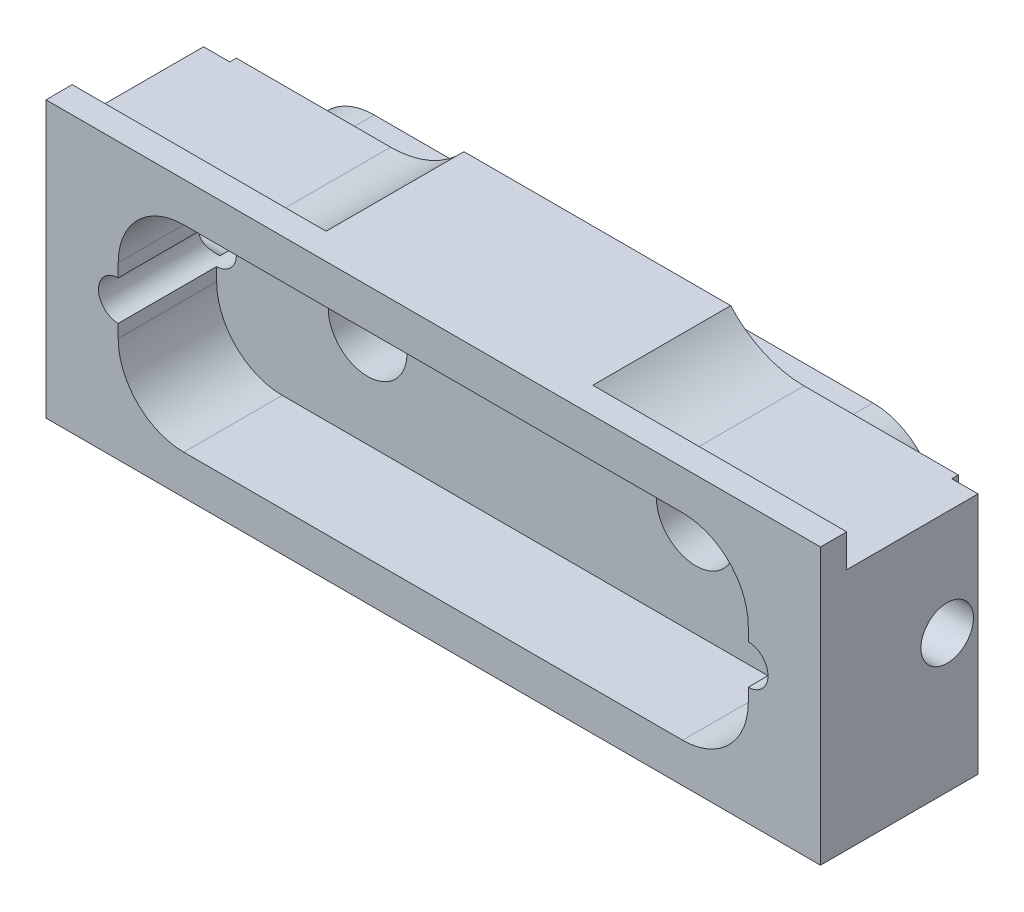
ISO-10303-21;
HEADER;
FILE_DESCRIPTION(('STEP AP214'),'2;1');
FILE_NAME('part.step','',(''),(''),'','','');
FILE_SCHEMA(('AUTOMOTIVE_DESIGN { 1 0 10303 214 1 1 1 1 }'));
ENDSEC;
DATA;
#1=APPLICATION_CONTEXT('core data for automotive mechanical design processes');
#2=APPLICATION_PROTOCOL_DEFINITION('international standard','automotive_design',2000,#1);
#3=PRODUCT_CONTEXT('',#1,'mechanical');
#4=PRODUCT('Part','Part','',(#3));
#5=PRODUCT_RELATED_PRODUCT_CATEGORY('part','',(#4));
#6=PRODUCT_DEFINITION_FORMATION('','',#4);
#7=PRODUCT_DEFINITION_CONTEXT('part definition',#1,'design');
#8=PRODUCT_DEFINITION('design','',#6,#7);
#9=PRODUCT_DEFINITION_SHAPE('','',#8);
#10=(LENGTH_UNIT() NAMED_UNIT(*) SI_UNIT(.MILLI.,.METRE.));
#11=(NAMED_UNIT(*) PLANE_ANGLE_UNIT() SI_UNIT($,.RADIAN.));
#12=(NAMED_UNIT(*) SI_UNIT($,.STERADIAN.) SOLID_ANGLE_UNIT());
#13=UNCERTAINTY_MEASURE_WITH_UNIT(LENGTH_MEASURE(1.E-05),#10,'distance_accuracy_value','');
#14=(GEOMETRIC_REPRESENTATION_CONTEXT(3) GLOBAL_UNCERTAINTY_ASSIGNED_CONTEXT((#13)) GLOBAL_UNIT_ASSIGNED_CONTEXT((#10,
#11,#12)) REPRESENTATION_CONTEXT('',''));
#15=CARTESIAN_POINT('',(0.,0.,0.));
#16=DIRECTION('',(0.,0.,1.));
#17=DIRECTION('',(1.,0.,0.));
#18=AXIS2_PLACEMENT_3D('',#15,#16,#17);
#19=CARTESIAN_POINT('',(-22.9999999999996,-2.18283300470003E-08,-4.001));
#20=DIRECTION('',(0.,0.,1.));
#21=DIRECTION('',(0.,-1.,0.));
#22=AXIS2_PLACEMENT_3D('',#19,#20,#21);
#23=CYLINDRICAL_SURFACE('',#22,3.);
#24=CARTESIAN_POINT('',(-23.0000000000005,2.52390235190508E-06,10.));
#25=DIRECTION('',(0.,0.,-1.));
#26=DIRECTION('',(0.,-1.,0.));
#27=AXIS2_PLACEMENT_3D('',#24,#25,#26);
#28=CIRCLE('',#27,3.);
#29=CARTESIAN_POINT('',(-23.0000000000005,2.99999997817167,10.));
#30=VERTEX_POINT('',#29);
#31=CARTESIAN_POINT('',(-23.0000000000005,-2.99999747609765,10.));
#32=VERTEX_POINT('',#31);
#33=EDGE_CURVE('E388',#30,#32,#28,.T.);
#34=ORIENTED_EDGE('',*,*,#33,.F.);
#35=DIRECTION('',(0.,0.,1.));
#36=VECTOR('',#35,1.);
#37=CARTESIAN_POINT('',(-23.0000000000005,3.00000252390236,10.));
#38=LINE('',#37,#36);
#39=CARTESIAN_POINT('',(-23.0000000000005,3.00000252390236,25.));
#40=VERTEX_POINT('',#39);
#41=EDGE_CURVE('E451',#30,#40,#38,.T.);
#42=ORIENTED_EDGE('',*,*,#41,.T.);
#43=CARTESIAN_POINT('',(-22.9999999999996,-2.18283300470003E-08,25.));
#44=DIRECTION('',(0.,0.,1.));
#45=DIRECTION('',(0.,-1.,0.));
#46=AXIS2_PLACEMENT_3D('',#43,#44,#45);
#47=CIRCLE('',#46,3.);
#48=CARTESIAN_POINT('',(-23.0000000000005,-2.99999747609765,25.));
#49=VERTEX_POINT('',#48);
#50=EDGE_CURVE('E482',#40,#49,#47,.T.);
#51=ORIENTED_EDGE('',*,*,#50,.T.);
#52=DIRECTION('',(0.,0.,1.));
#53=VECTOR('',#52,1.);
#54=CARTESIAN_POINT('',(-23.0000000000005,-2.99999747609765,10.));
#55=LINE('',#54,#53);
#56=EDGE_CURVE('E424',#32,#49,#55,.T.);
#57=ORIENTED_EDGE('',*,*,#56,.F.);
#58=EDGE_LOOP('',(#34,#42,#51,#57));
#59=FACE_BOUND('',#58,.T.);
#60=DIRECTION('',(0.,0.,1.));
#61=VECTOR('',#60,1.);
#62=CARTESIAN_POINT('',(-23.0000004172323,2.99999997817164,-4.001));
#63=LINE('',#62,#61);
#64=CARTESIAN_POINT('',(-23.0000004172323,2.99999997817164,0.));
#65=VERTEX_POINT('',#64);
#66=CARTESIAN_POINT('',(-23.0000004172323,2.99999997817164,-4.));
#67=VERTEX_POINT('',#66);
#68=EDGE_CURVE('E490',#65,#67,#63,.F.);
#69=ORIENTED_EDGE('',*,*,#68,.T.);
#70=CARTESIAN_POINT('',(-22.9999999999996,-2.18283300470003E-08,-4.));
#71=DIRECTION('',(0.,0.,-1.));
#72=DIRECTION('',(0.,1.,0.));
#73=AXIS2_PLACEMENT_3D('',#70,#71,#72);
#74=CIRCLE('',#73,3.);
#75=CARTESIAN_POINT('',(-23.0000004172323,-3.0000000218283,-4.));
#76=VERTEX_POINT('',#75);
#77=EDGE_CURVE('E485',#76,#67,#74,.F.);
#78=ORIENTED_EDGE('',*,*,#77,.F.);
#79=DIRECTION('',(0.,0.,1.));
#80=VECTOR('',#79,1.);
#81=CARTESIAN_POINT('',(-23.0000004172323,-3.0000000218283,-4.001));
#82=LINE('',#81,#80);
#83=CARTESIAN_POINT('',(-23.0000004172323,-3.0000000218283,0.));
#84=VERTEX_POINT('',#83);
#85=EDGE_CURVE('E488',#76,#84,#82,.T.);
#86=ORIENTED_EDGE('',*,*,#85,.T.);
#87=CARTESIAN_POINT('',(-22.9999999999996,-2.18283300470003E-08,0.));
#88=DIRECTION('',(0.,0.,-1.));
#89=DIRECTION('',(0.,1.,0.));
#90=AXIS2_PLACEMENT_3D('',#87,#88,#89);
#91=CIRCLE('',#90,3.);
#92=EDGE_CURVE('E492',#65,#84,#91,.F.);
#93=ORIENTED_EDGE('',*,*,#92,.F.);
#94=EDGE_LOOP('',(#69,#78,#86,#93));
#95=FACE_BOUND('',#94,.T.);
#96=DIRECTION('',(0.,0.,1.));
#97=VECTOR('',#96,1.);
#98=CARTESIAN_POINT('',(-24.0000003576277,-2.82842702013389,-4.001));
#99=LINE('',#98,#97);
#100=CARTESIAN_POINT('',(-24.0000003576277,-2.82842702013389,8.5230822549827));
#101=VERTEX_POINT('',#100);
#102=CARTESIAN_POINT('',(-24.0000003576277,-2.82842702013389,2.86623328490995));
#103=VERTEX_POINT('',#102);
#104=EDGE_CURVE('E696',#101,#103,#99,.F.);
#105=ORIENTED_EDGE('',*,*,#104,.F.);
#106=CARTESIAN_POINT('',(-24.0000003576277,-2.82842702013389,8.5230822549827));
#107=CARTESIAN_POINT('',(-24.0856667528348,-2.79811739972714,8.55340948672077));
#108=CARTESIAN_POINT('',(-24.1690774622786,-2.76427027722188,8.58626782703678));
#109=CARTESIAN_POINT('',(-24.3312310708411,-2.68994439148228,8.65552432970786));
#110=CARTESIAN_POINT('',(-24.4099793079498,-2.64947341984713,8.69191831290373));
#111=CARTESIAN_POINT('',(-24.5630665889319,-2.56214807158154,8.76690662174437));
#112=CARTESIAN_POINT('',(-24.6373926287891,-2.5152760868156,8.80550683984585));
#113=CARTESIAN_POINT('',(-24.7813467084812,-2.41546643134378,8.88362807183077));
#114=CARTESIAN_POINT('',(-24.8509731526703,-2.36252671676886,8.92314939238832));
#115=CARTESIAN_POINT('',(-25.0521066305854,-2.19526996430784,9.04119486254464));
#116=CARTESIAN_POINT('',(-25.1765548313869,-2.07212119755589,9.11955577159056));
#117=CARTESIAN_POINT('',(-25.4038657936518,-1.80341070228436,9.26834605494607));
#118=CARTESIAN_POINT('',(-25.5067634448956,-1.65788587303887,9.33878816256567));
#119=CARTESIAN_POINT('',(-25.6686688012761,-1.37794373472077,9.45220835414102));
#120=CARTESIAN_POINT('',(-25.7323482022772,-1.24732522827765,9.49785735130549));
#121=CARTESIAN_POINT('',(-25.8409397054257,-0.974939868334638,9.5766070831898));
#122=CARTESIAN_POINT('',(-25.8858664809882,-0.833181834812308,9.60971762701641));
#123=CARTESIAN_POINT('',(-25.9546650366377,-0.540933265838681,9.66070146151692));
#124=CARTESIAN_POINT('',(-25.9784018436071,-0.390393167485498,9.67847704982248));
#125=CARTESIAN_POINT('',(-26.0026229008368,-0.0864119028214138,9.69661658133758));
#126=CARTESIAN_POINT('',(-26.0031161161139,0.0670281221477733,9.69698723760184));
#127=CARTESIAN_POINT('',(-25.9820149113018,0.355400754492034,9.68118273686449));
#128=CARTESIAN_POINT('',(-25.9627006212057,0.490605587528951,9.66671560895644));
#129=CARTESIAN_POINT('',(-25.9065327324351,0.755227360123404,9.62499918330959));
#130=CARTESIAN_POINT('',(-25.8696778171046,0.884643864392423,9.59774892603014));
#131=CARTESIAN_POINT('',(-25.7788101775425,1.13886835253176,9.53142695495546));
#132=CARTESIAN_POINT('',(-25.7242955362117,1.26340445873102,9.49201125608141));
#133=CARTESIAN_POINT('',(-25.6006313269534,1.50158264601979,9.40429280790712));
#134=CARTESIAN_POINT('',(-25.531472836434,1.61521802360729,9.35598464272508));
#135=CARTESIAN_POINT('',(-25.3678830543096,1.84842054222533,9.24468563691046));
#136=CARTESIAN_POINT('',(-25.2711625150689,1.96584520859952,9.18058847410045));
#137=CARTESIAN_POINT('',(-25.0625186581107,2.18375804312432,9.04837898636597));
#138=CARTESIAN_POINT('',(-24.9505888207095,2.28423890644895,8.98026494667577));
#139=CARTESIAN_POINT('',(-24.7698588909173,2.42357010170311,8.87740011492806));
#140=CARTESIAN_POINT('',(-24.7061170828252,2.4688674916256,8.84231446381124));
#141=CARTESIAN_POINT('',(-24.57490222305,2.55456877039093,8.77316709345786));
#142=CARTESIAN_POINT('',(-24.5074301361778,2.59497391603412,8.73910511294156));
#143=CARTESIAN_POINT('',(-24.368793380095,2.67070152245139,8.67289421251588));
#144=CARTESIAN_POINT('',(-24.2976292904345,2.70602477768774,8.64074499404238));
#145=CARTESIAN_POINT('',(-24.1515801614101,2.77132609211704,8.57940990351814));
#146=CARTESIAN_POINT('',(-24.0766915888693,2.80129894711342,8.55022692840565));
#147=CARTESIAN_POINT('',(-24.0000003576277,2.82842697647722,8.52308778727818));
#148=B_SPLINE_CURVE_WITH_KNOTS('',3,(#106,#107,#108,#109,#110,#111,#112,#113,#114,#115,#116,
#117,#118,#119,#120,#121,#122,#123,#124,#125,#126,#127,#128,#129,#130,#131,#132,#133,#134,#135,
#136,#137,#138,#139,#140,#141,#142,#143,#144,#145,#146,#147),.UNSPECIFIED.,.F.,.F.,(4,2,2,2,2,2,
2,2,2,2,2,2,2,2,2,2,2,2,2,2,4),(0.,0.287127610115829,0.573919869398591,0.861517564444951,
1.1492124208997,1.72202682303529,2.29390655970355,2.74902127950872,3.20377921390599,
3.66141355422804,4.11887138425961,4.52899599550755,4.93915139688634,5.36217184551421,
5.7854507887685,6.27893824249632,6.77263790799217,7.02957736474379,7.28645067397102,
7.54328378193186,7.80036535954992),.UNSPECIFIED.);
#149=CARTESIAN_POINT('',(-24.0000003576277,2.82842697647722,8.52308778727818));
#150=VERTEX_POINT('',#149);
#151=EDGE_CURVE('E682',#101,#150,#148,.T.);
#152=ORIENTED_EDGE('',*,*,#151,.T.);
#153=DIRECTION('',(0.,0.,1.));
#154=VECTOR('',#153,1.);
#155=CARTESIAN_POINT('',(-24.0000003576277,2.82842697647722,-4.001));
#156=LINE('',#155,#154);
#157=CARTESIAN_POINT('',(-24.0000003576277,2.82842697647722,2.86622775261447));
#158=VERTEX_POINT('',#157);
#159=EDGE_CURVE('E1125',#158,#150,#156,.T.);
#160=ORIENTED_EDGE('',*,*,#159,.F.);
#161=CARTESIAN_POINT('',(-24.0000003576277,2.82842697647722,2.86622775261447));
#162=CARTESIAN_POINT('',(-24.0856667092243,2.79811737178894,2.83590065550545));
#163=CARTESIAN_POINT('',(-24.1690773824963,2.76427026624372,2.80304245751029));
#164=CARTESIAN_POINT('',(-24.331230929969,2.6899444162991,2.73378624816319));
#165=CARTESIAN_POINT('',(-24.4099791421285,2.64947346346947,2.69739241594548));
#166=CARTESIAN_POINT('',(-24.5630663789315,2.56214815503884,2.62240441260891));
#167=CARTESIAN_POINT('',(-24.6373923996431,2.51527619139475,2.58380434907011));
#168=CARTESIAN_POINT('',(-24.7813464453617,2.41546658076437,2.50568342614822));
#169=CARTESIAN_POINT('',(-24.8509728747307,2.36252688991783,2.46616226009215));
#170=CARTESIAN_POINT('',(-25.0521063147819,2.19527021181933,2.34811724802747));
#171=CARTESIAN_POINT('',(-25.1765544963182,2.07212150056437,2.26975663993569));
#172=CARTESIAN_POINT('',(-25.4038654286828,1.8034111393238,2.1209669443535));
#173=CARTESIAN_POINT('',(-25.50676306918,1.65788638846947,2.05052512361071));
#174=CARTESIAN_POINT('',(-25.6686684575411,1.37794435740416,1.93710540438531));
#175=CARTESIAN_POINT('',(-25.7323478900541,1.24732586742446,1.89145660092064));
#176=CARTESIAN_POINT('',(-25.8409394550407,0.974940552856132,1.8127072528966));
#177=CARTESIAN_POINT('',(-25.8858662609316,0.833182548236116,1.77959689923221));
#178=CARTESIAN_POINT('',(-25.9546648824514,0.540934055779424,1.72861344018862));
#179=CARTESIAN_POINT('',(-25.9784017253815,0.390394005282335,1.71083803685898));
#180=CARTESIAN_POINT('',(-26.0026228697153,0.0864128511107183,1.69269886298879));
#181=CARTESIAN_POINT('',(-26.0031161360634,-0.0670271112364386,1.69232837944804));
#182=CARTESIAN_POINT('',(-25.9820150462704,-0.355399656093,1.70813319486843));
#183=CARTESIAN_POINT('',(-25.9627008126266,-0.490604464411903,1.72260047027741));
#184=CARTESIAN_POINT('',(-25.9065330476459,-0.755226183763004,1.7643171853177));
#185=CARTESIAN_POINT('',(-25.8696781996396,-0.884642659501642,1.79156758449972));
#186=CARTESIAN_POINT('',(-25.7788106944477,-1.13886713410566,1.85788985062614));
#187=CARTESIAN_POINT('',(-25.7242961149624,-1.26340325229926,1.89730570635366));
#188=CARTESIAN_POINT('',(-25.600632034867,-1.501581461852,1.98502447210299));
#189=CARTESIAN_POINT('',(-25.5314736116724,-1.61521684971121,2.0333327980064));
#190=CARTESIAN_POINT('',(-25.3678839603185,-1.84841942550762,2.14463217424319));
#191=CARTESIAN_POINT('',(-25.2711634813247,-1.96584413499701,2.20872955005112));
#192=CARTESIAN_POINT('',(-25.0625197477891,-2.18375705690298,2.34093947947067));
#193=CARTESIAN_POINT('',(-24.9505899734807,-2.28423796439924,2.40905374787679));
#194=CARTESIAN_POINT('',(-24.7698600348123,-2.42356931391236,2.51191900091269));
#195=CARTESIAN_POINT('',(-24.7061181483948,-2.46886680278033,2.54700483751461));
#196=CARTESIAN_POINT('',(-24.5749031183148,-2.55456826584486,2.61615257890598));
#197=CARTESIAN_POINT('',(-24.5074309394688,-2.59497349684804,2.65021474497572));
#198=CARTESIAN_POINT('',(-24.3687939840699,-2.67070126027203,2.7164260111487));
#199=CARTESIAN_POINT('',(-24.297629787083,-2.7060245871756,2.74857540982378));
#200=CARTESIAN_POINT('',(-24.151580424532,-2.77132603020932,2.80991084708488));
#201=CARTESIAN_POINT('',(-24.0766917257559,-2.80129894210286,2.8390939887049));
#202=CARTESIAN_POINT('',(-24.0000003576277,-2.82842702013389,2.86623328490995));
#203=B_SPLINE_CURVE_WITH_KNOTS('',3,(#161,#162,#163,#164,#165,#166,#167,#168,#169,#170,#171,
#172,#173,#174,#175,#176,#177,#178,#179,#180,#181,#182,#183,#184,#185,#186,#187,#188,#189,#190,
#191,#192,#193,#194,#195,#196,#197,#198,#199,#200,#201,#202),.UNSPECIFIED.,.F.,.F.,(4,2,2,2,2,2,
2,2,2,2,2,2,2,2,2,2,2,2,2,2,4),(0.,0.287127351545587,0.573919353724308,0.861516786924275,
1.14921138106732,1.72202527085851,2.29390449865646,2.74901904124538,3.20377679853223,
3.66141095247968,4.11886859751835,4.52899315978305,4.93914851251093,5.3621690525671,
5.78544808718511,6.27893577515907,6.7726356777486,7.02957569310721,7.28644956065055,
7.54328322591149,7.80036536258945),.UNSPECIFIED.);
#204=EDGE_CURVE('E689',#158,#103,#203,.T.);
#205=ORIENTED_EDGE('',*,*,#204,.T.);
#206=EDGE_LOOP('',(#105,#152,#160,#205));
#207=FACE_BOUND('',#206,.T.);
#208=ADVANCED_FACE('F14',(#59,#95,#207),#23,.F.);
#209=CARTESIAN_POINT('',(73.,2.90882505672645E-06,-4.001));
#210=DIRECTION('',(0.,0.,1.));
#211=DIRECTION('',(0.,-1.,0.));
#212=AXIS2_PLACEMENT_3D('',#209,#210,#211);
#213=CYLINDRICAL_SURFACE('',#212,3.);
#214=DIRECTION('',(0.,0.,1.));
#215=VECTOR('',#214,1.);
#216=CARTESIAN_POINT('',(72.9999995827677,-2.99999709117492,-4.001));
#217=LINE('',#216,#215);
#218=CARTESIAN_POINT('',(72.9999995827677,-2.99999709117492,0.));
#219=VERTEX_POINT('',#218);
#220=CARTESIAN_POINT('',(72.9999995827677,-2.99999709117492,-4.));
#221=VERTEX_POINT('',#220);
#222=EDGE_CURVE('E503',#219,#221,#217,.F.);
#223=ORIENTED_EDGE('',*,*,#222,.T.);
#224=CARTESIAN_POINT('',(73.,2.90882505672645E-06,-4.));
#225=DIRECTION('',(0.,0.,-1.));
#226=DIRECTION('',(0.,1.,0.));
#227=AXIS2_PLACEMENT_3D('',#224,#225,#226);
#228=CIRCLE('',#227,3.);
#229=CARTESIAN_POINT('',(72.9999995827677,3.00000290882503,-4.));
#230=VERTEX_POINT('',#229);
#231=EDGE_CURVE('E498',#230,#221,#228,.F.);
#232=ORIENTED_EDGE('',*,*,#231,.F.);
#233=DIRECTION('',(0.,0.,1.));
#234=VECTOR('',#233,1.);
#235=CARTESIAN_POINT('',(72.9999995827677,3.00000290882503,-4.001));
#236=LINE('',#235,#234);
#237=CARTESIAN_POINT('',(72.9999995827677,3.00000290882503,0.));
#238=VERTEX_POINT('',#237);
#239=EDGE_CURVE('E501',#230,#238,#236,.T.);
#240=ORIENTED_EDGE('',*,*,#239,.T.);
#241=CARTESIAN_POINT('',(73.,2.90882505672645E-06,0.));
#242=DIRECTION('',(0.,0.,-1.));
#243=DIRECTION('',(0.,1.,0.));
#244=AXIS2_PLACEMENT_3D('',#241,#242,#243);
#245=CIRCLE('',#244,3.);
#246=EDGE_CURVE('E505',#219,#238,#245,.F.);
#247=ORIENTED_EDGE('',*,*,#246,.F.);
#248=EDGE_LOOP('',(#223,#232,#240,#247));
#249=FACE_BOUND('',#248,.T.);
#250=CARTESIAN_POINT('',(73.,2.90882505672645E-06,25.));
#251=DIRECTION('',(0.,0.,1.));
#252=DIRECTION('',(0.,-1.,0.));
#253=AXIS2_PLACEMENT_3D('',#250,#251,#252);
#254=CIRCLE('',#253,3.);
#255=CARTESIAN_POINT('',(73.,-2.99999709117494,25.));
#256=VERTEX_POINT('',#255);
#257=CARTESIAN_POINT('',(73.,3.00000290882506,25.));
#258=VERTEX_POINT('',#257);
#259=EDGE_CURVE('E495',#256,#258,#254,.T.);
#260=ORIENTED_EDGE('',*,*,#259,.T.);
#261=DIRECTION('',(0.,0.,1.));
#262=VECTOR('',#261,1.);
#263=CARTESIAN_POINT('',(73.,3.00000290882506,10.));
#264=LINE('',#263,#262);
#265=CARTESIAN_POINT('',(73.,3.00000290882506,10.));
#266=VERTEX_POINT('',#265);
#267=EDGE_CURVE('E463',#266,#258,#264,.T.);
#268=ORIENTED_EDGE('',*,*,#267,.F.);
#269=CARTESIAN_POINT('',(73.,2.90882505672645E-06,10.));
#270=DIRECTION('',(0.,0.,-1.));
#271=DIRECTION('',(0.,-1.,0.));
#272=AXIS2_PLACEMENT_3D('',#269,#270,#271);
#273=CIRCLE('',#272,3.);
#274=CARTESIAN_POINT('',(73.,-2.99999709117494,10.));
#275=VERTEX_POINT('',#274);
#276=EDGE_CURVE('E407',#275,#266,#273,.T.);
#277=ORIENTED_EDGE('',*,*,#276,.F.);
#278=DIRECTION('',(0.,0.,1.));
#279=VECTOR('',#278,1.);
#280=CARTESIAN_POINT('',(73.,-2.99999709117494,10.));
#281=LINE('',#280,#279);
#282=EDGE_CURVE('E465',#275,#256,#281,.T.);
#283=ORIENTED_EDGE('',*,*,#282,.T.);
#284=EDGE_LOOP('',(#260,#268,#277,#283));
#285=FACE_BOUND('',#284,.T.);
#286=DIRECTION('',(0.,0.,1.));
#287=VECTOR('',#286,1.);
#288=CARTESIAN_POINT('',(73.9999996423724,2.82843016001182,-4.001));
#289=LINE('',#288,#287);
#290=CARTESIAN_POINT('',(73.9999996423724,2.82843016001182,8.52308460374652));
#291=VERTEX_POINT('',#290);
#292=CARTESIAN_POINT('',(73.9999996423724,2.82843016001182,2.86623093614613));
#293=VERTEX_POINT('',#292);
#294=EDGE_CURVE('E1120',#291,#293,#289,.F.);
#295=ORIENTED_EDGE('',*,*,#294,.F.);
#296=CARTESIAN_POINT('',(73.9999996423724,2.82843016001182,8.52308460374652));
#297=CARTESIAN_POINT('',(74.0856660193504,2.79812057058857,8.55341175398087));
#298=CARTESIAN_POINT('',(74.16907671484,2.76427347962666,8.58627001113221));
#299=CARTESIAN_POINT('',(74.3312303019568,2.68994765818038,8.65552634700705));
#300=CARTESIAN_POINT('',(74.4099785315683,2.64947671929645,8.69192024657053));
#301=CARTESIAN_POINT('',(74.5630658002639,2.56215143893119,8.76690838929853));
#302=CARTESIAN_POINT('',(74.6373918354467,2.51527948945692,8.80550852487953));
#303=CARTESIAN_POINT('',(74.7813459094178,2.41546990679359,8.88362959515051));
#304=CARTESIAN_POINT('',(74.8509723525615,2.36253022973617,8.92315083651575));
#305=CARTESIAN_POINT('',(75.0521058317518,2.19527359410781,9.04119607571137));
#306=CARTESIAN_POINT('',(75.1765540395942,2.07212491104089,9.11955683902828));
#307=CARTESIAN_POINT('',(75.4038650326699,1.80341459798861,9.2683468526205));
#308=CARTESIAN_POINT('',(75.5067627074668,1.65788986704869,9.33878883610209));
#309=CARTESIAN_POINT('',(75.6686681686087,1.37794784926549,9.45220885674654));
#310=CARTESIAN_POINT('',(75.7323476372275,1.24732935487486,9.49785779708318));
#311=CARTESIAN_POINT('',(75.8409392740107,0.974944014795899,9.57660741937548));
#312=CARTESIAN_POINT('',(75.8858661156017,0.833185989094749,9.60971791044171));
#313=CARTESIAN_POINT('',(75.9546648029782,0.540937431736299,9.66070164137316));
#314=CARTESIAN_POINT('',(75.9784016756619,0.390397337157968,9.67847717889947));
#315=CARTESIAN_POINT('',(76.00262286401,0.086416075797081,9.69661660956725));
#316=CARTESIAN_POINT('',(76.0031161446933,-0.0670239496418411,9.6969872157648));
#317=CARTESIAN_POINT('',(75.9820150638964,-0.355396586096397,9.68118261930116));
#318=CARTESIAN_POINT('',(75.9627008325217,-0.490601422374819,9.66671544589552));
#319=CARTESIAN_POINT('',(75.9065330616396,-0.755223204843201,9.62499892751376));
#320=CARTESIAN_POINT('',(75.8696782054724,-0.884639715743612,9.59774862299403));
#321=CARTESIAN_POINT('',(75.7788106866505,-1.13886422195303,9.53142655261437));
#322=CARTESIAN_POINT('',(75.724296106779,-1.26340033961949,9.49201080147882));
#323=CARTESIAN_POINT('',(75.6006320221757,-1.50157855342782,9.4042922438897));
#324=CARTESIAN_POINT('',(75.5314735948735,-1.61521394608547,9.35598402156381));
#325=CARTESIAN_POINT('',(75.3678839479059,-1.84841650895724,9.2446848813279));
#326=CARTESIAN_POINT('',(75.2711634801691,-1.96584120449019,9.18058763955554));
#327=CARTESIAN_POINT('',(75.0625197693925,-2.18375410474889,9.04837797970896));
#328=CARTESIAN_POINT('',(74.9505900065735,-2.28423500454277,8.98026384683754));
#329=CARTESIAN_POINT('',(74.7698600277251,-2.4235663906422,8.87739876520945));
#330=CARTESIAN_POINT('',(74.7061180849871,-2.46886391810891,8.84231296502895));
#331=CARTESIAN_POINT('',(74.5749029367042,-2.55456544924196,8.77316529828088));
#332=CARTESIAN_POINT('',(74.5074306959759,-2.59497070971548,8.73910317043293));
#333=CARTESIAN_POINT('',(74.3687936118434,-2.67069852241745,8.6728919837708));
#334=CARTESIAN_POINT('',(74.2976293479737,-2.70602186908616,8.64074262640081));
#335=CARTESIAN_POINT('',(74.1515798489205,-2.77132334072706,8.57940727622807));
#336=CARTESIAN_POINT('',(74.0766910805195,-2.80129626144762,8.5502241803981));
#337=CARTESIAN_POINT('',(73.9999996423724,-2.8284243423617,8.52308493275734));
#338=B_SPLINE_CURVE_WITH_KNOTS('',3,(#296,#297,#298,#299,#300,#301,#302,#303,#304,#305,#306,
#307,#308,#309,#310,#311,#312,#313,#314,#315,#316,#317,#318,#319,#320,#321,#322,#323,#324,#325,
#326,#327,#328,#329,#330,#331,#332,#333,#334,#335,#336,#337),.UNSPECIFIED.,.F.,.F.,(4,2,2,2,2,2,
2,2,2,2,2,2,2,2,2,2,2,2,2,2,4),(0.,0.287127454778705,0.573919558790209,0.861517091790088,
1.14921178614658,1.72202586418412,2.29390528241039,2.74902000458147,3.20377794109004,
3.66141228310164,4.1188701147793,4.5289947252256,4.93915012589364,5.36217057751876,
5.78544952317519,6.27893700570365,6.77263670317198,7.02957686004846,7.28645086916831,
7.54328467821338,7.80036695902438),.UNSPECIFIED.);
#339=CARTESIAN_POINT('',(73.9999996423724,-2.8284243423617,8.52308493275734));
#340=VERTEX_POINT('',#339);
#341=EDGE_CURVE('E605',#291,#340,#338,.T.);
#342=ORIENTED_EDGE('',*,*,#341,.T.);
#343=DIRECTION('',(0.,0.,1.));
#344=VECTOR('',#343,1.);
#345=CARTESIAN_POINT('',(73.9999996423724,-2.8284243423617,-4.001));
#346=LINE('',#345,#344);
#347=CARTESIAN_POINT('',(73.9999996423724,-2.8284243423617,2.86623060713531));
#348=VERTEX_POINT('',#347);
#349=EDGE_CURVE('E603',#348,#340,#346,.T.);
#350=ORIENTED_EDGE('',*,*,#349,.F.);
#351=CARTESIAN_POINT('',(73.9999996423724,-2.8284243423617,2.86623060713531));
#352=CARTESIAN_POINT('',(74.0856660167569,-2.79811475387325,2.83590346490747));
#353=CARTESIAN_POINT('',(74.1690767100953,-2.76426766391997,2.80304521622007));
#354=CARTESIAN_POINT('',(74.331230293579,-2.68994184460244,2.73378889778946));
#355=CARTESIAN_POINT('',(74.4099785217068,-2.64947090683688,2.69739500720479));
#356=CARTESIAN_POINT('',(74.563065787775,-2.56214562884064,2.62240688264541));
#357=CARTESIAN_POINT('',(74.6373918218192,-2.51527368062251,2.58380675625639));
#358=CARTESIAN_POINT('',(74.7813458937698,-2.41546410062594,2.50568570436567));
#359=CARTESIAN_POINT('',(74.8509723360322,-2.36252442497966,2.46616447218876));
#360=CARTESIAN_POINT('',(75.0521058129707,-2.19526779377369,2.34811926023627));
#361=CARTESIAN_POINT('',(75.1765540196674,-2.07211911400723,2.26975851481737));
#362=CARTESIAN_POINT('',(75.4038650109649,-1.80340880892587,2.12096853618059));
#363=CARTESIAN_POINT('',(75.5067626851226,-1.65788408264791,2.05052656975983));
#364=CARTESIAN_POINT('',(75.6686681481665,-1.37794207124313,1.93710657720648));
#365=CARTESIAN_POINT('',(75.7323476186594,-1.24732357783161,1.89145764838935));
#366=CARTESIAN_POINT('',(75.8409392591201,-0.974938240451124,1.81270804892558));
#367=CARTESIAN_POINT('',(75.8858661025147,-0.833180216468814,1.77959756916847));
#368=CARTESIAN_POINT('',(75.9546647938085,-0.540931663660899,1.72861386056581));
#369=CARTESIAN_POINT('',(75.9784016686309,-0.390391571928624,1.7108383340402));
#370=CARTESIAN_POINT('',(76.0026228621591,-0.0864103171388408,1.69269892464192));
#371=CARTESIAN_POINT('',(76.0031161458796,0.0670297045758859,1.69232832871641));
#372=CARTESIAN_POINT('',(75.982015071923,0.355402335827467,1.70813294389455));
#373=CARTESIAN_POINT('',(75.9627008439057,0.49060717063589,1.72260012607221));
#374=CARTESIAN_POINT('',(75.9065330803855,0.75522894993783,1.76431666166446));
#375=CARTESIAN_POINT('',(75.8696782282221,0.884645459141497,1.79156697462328));
#376=CARTESIAN_POINT('',(75.7788107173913,1.13886996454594,1.85788906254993));
#377=CARTESIAN_POINT('',(75.7242961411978,1.26340608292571,1.8973048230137));
#378=CARTESIAN_POINT('',(75.600632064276,1.50158429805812,1.98502339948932));
#379=CARTESIAN_POINT('',(75.5314736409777,1.61521969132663,2.03333163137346));
#380=CARTESIAN_POINT('',(75.3678840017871,1.84842225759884,2.14463079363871));
#381=CARTESIAN_POINT('',(75.2711635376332,1.96584695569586,2.20872804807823));
#382=CARTESIAN_POINT('',(75.0625198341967,2.1837598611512,2.34093773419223));
#383=CARTESIAN_POINT('',(74.9505900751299,2.28424076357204,2.40905188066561));
#384=CARTESIAN_POINT('',(74.7698600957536,2.42357215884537,2.5119169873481));
#385=CARTESIAN_POINT('',(74.7061181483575,2.46886969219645,2.54700279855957));
#386=CARTESIAN_POINT('',(74.5749029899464,2.55457123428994,2.61615048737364));
#387=CARTESIAN_POINT('',(74.5074307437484,2.5949764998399,2.65021262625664));
#388=CARTESIAN_POINT('',(74.3687936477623,2.67070432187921,2.71642383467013));
#389=CARTESIAN_POINT('',(74.2976293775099,2.70602767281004,2.74857320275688));
#390=CARTESIAN_POINT('',(74.1515798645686,2.77132915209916,2.8099085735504));
#391=CARTESIAN_POINT('',(74.0766910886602,2.80130207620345,2.83909167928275));
#392=CARTESIAN_POINT('',(73.9999996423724,2.82843016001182,2.86623093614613));
#393=B_SPLINE_CURVE_WITH_KNOTS('',3,(#351,#352,#353,#354,#355,#356,#357,#358,#359,#360,#361,
#362,#363,#364,#365,#366,#367,#368,#369,#370,#371,#372,#373,#374,#375,#376,#377,#378,#379,#380,
#381,#382,#383,#384,#385,#386,#387,#388,#389,#390,#391,#392),.UNSPECIFIED.,.F.,.F.,(4,2,2,2,2,2,
2,2,2,2,2,2,2,2,2,2,2,2,2,2,4),(0.,0.287127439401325,0.573919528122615,0.861517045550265,
1.14921172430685,1.72202577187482,2.29390515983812,2.74901987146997,3.2037777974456,
3.6614121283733,4.11886994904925,4.52899455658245,4.93914995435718,5.3621704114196,
5.78544936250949,6.27893685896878,6.77263657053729,7.02957676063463,7.28645080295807,
7.5432846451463,7.80036695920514),.UNSPECIFIED.);
#394=EDGE_CURVE('E614',#348,#293,#393,.T.);
#395=ORIENTED_EDGE('',*,*,#394,.T.);
#396=EDGE_LOOP('',(#295,#342,#350,#395));
#397=FACE_BOUND('',#396,.T.);
#398=ADVANCED_FACE('F620',(#249,#285,#397),#213,.F.);
#399=CARTESIAN_POINT('',(50.,2.74431966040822E-06,25.));
#400=DIRECTION('',(0.,0.,-1.));
#401=DIRECTION('',(0.,1.,0.));
#402=AXIS2_PLACEMENT_3D('',#399,#400,#401);
#403=CYLINDRICAL_SURFACE('',#402,6.);
#404=CARTESIAN_POINT('',(50.,2.74431966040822E-06,-4.));
#405=DIRECTION('',(0.,0.,-1.));
#406=DIRECTION('',(0.,1.,0.));
#407=AXIS2_PLACEMENT_3D('',#404,#405,#406);
#408=CIRCLE('',#407,6.);
#409=CARTESIAN_POINT('',(50.,6.00000274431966,-4.));
#410=VERTEX_POINT('',#409);
#411=EDGE_CURVE('E508',#410,#410,#408,.F.);
#412=ORIENTED_EDGE('',*,*,#411,.F.);
#413=EDGE_LOOP('',(#412));
#414=FACE_BOUND('',#413,.T.);
#415=CARTESIAN_POINT('',(50.,2.74431966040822E-06,10.));
#416=DIRECTION('',(0.,0.,1.));
#417=DIRECTION('',(0.,-1.,0.));
#418=AXIS2_PLACEMENT_3D('',#415,#416,#417);
#419=CIRCLE('',#418,6.);
#420=CARTESIAN_POINT('',(50.,-5.99999725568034,10.));
#421=VERTEX_POINT('',#420);
#422=EDGE_CURVE('E479',#421,#421,#419,.T.);
#423=ORIENTED_EDGE('',*,*,#422,.T.);
#424=EDGE_LOOP('',(#423));
#425=FACE_BOUND('',#424,.T.);
#426=ADVANCED_FACE('F1038',(#414,#425),#403,.F.);
#427=CARTESIAN_POINT('',(0.,0.,25.));
#428=DIRECTION('',(0.,0.,-1.));
#429=DIRECTION('',(0.,1.,0.));
#430=AXIS2_PLACEMENT_3D('',#427,#428,#429);
#431=CYLINDRICAL_SURFACE('',#430,6.);
#432=CARTESIAN_POINT('',(0.,0.,-4.));
#433=DIRECTION('',(0.,0.,-1.));
#434=DIRECTION('',(0.,1.,0.));
#435=AXIS2_PLACEMENT_3D('',#432,#433,#434);
#436=CIRCLE('',#435,6.);
#437=CARTESIAN_POINT('',(0.,6.,-4.));
#438=VERTEX_POINT('',#437);
#439=EDGE_CURVE('E511',#438,#438,#436,.F.);
#440=ORIENTED_EDGE('',*,*,#439,.F.);
#441=EDGE_LOOP('',(#440));
#442=FACE_BOUND('',#441,.T.);
#443=CARTESIAN_POINT('',(0.,0.,10.));
#444=DIRECTION('',(0.,0.,1.));
#445=DIRECTION('',(0.,-1.,0.));
#446=AXIS2_PLACEMENT_3D('',#443,#444,#445);
#447=CIRCLE('',#446,6.);
#448=CARTESIAN_POINT('',(0.,-6.,10.));
#449=VERTEX_POINT('',#448);
#450=EDGE_CURVE('E454',#449,#449,#447,.T.);
#451=ORIENTED_EDGE('',*,*,#450,.T.);
#452=EDGE_LOOP('',(#451));
#453=FACE_BOUND('',#452,.T.);
#454=ADVANCED_FACE('F1030',(#442,#453),#431,.F.);
#455=CARTESIAN_POINT('',(-23.0000004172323,-4.9999985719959,-4.));
#456=DIRECTION('',(1.,0.,0.));
#457=DIRECTION('',(0.,1.,0.));
#458=AXIS2_PLACEMENT_3D('',#455,#456,#457);
#459=PLANE('',#458);
#460=DIRECTION('',(0.,1.,0.));
#461=VECTOR('',#460,1.);
#462=CARTESIAN_POINT('',(-23.0000004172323,-4.9999985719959,-4.));
#463=LINE('',#462,#461);
#464=CARTESIAN_POINT('',(-23.0000004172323,5.0000014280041,-4.));
#465=VERTEX_POINT('',#464);
#466=EDGE_CURVE('E533',#67,#465,#463,.T.);
#467=ORIENTED_EDGE('',*,*,#466,.F.);
#468=ORIENTED_EDGE('',*,*,#68,.F.);
#469=DIRECTION('',(0.,1.,0.));
#470=VECTOR('',#469,1.);
#471=CARTESIAN_POINT('',(-23.0000004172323,-4.9999985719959,0.));
#472=LINE('',#471,#470);
#473=CARTESIAN_POINT('',(-23.0000004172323,5.0000014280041,0.));
#474=VERTEX_POINT('',#473);
#475=EDGE_CURVE('E555',#65,#474,#472,.T.);
#476=ORIENTED_EDGE('',*,*,#475,.T.);
#477=DIRECTION('',(0.,0.,1.));
#478=VECTOR('',#477,1.);
#479=CARTESIAN_POINT('',(-23.0000004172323,5.0000014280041,-4.));
#480=LINE('',#479,#478);
#481=EDGE_CURVE('E537',#465,#474,#480,.T.);
#482=ORIENTED_EDGE('',*,*,#481,.F.);
#483=EDGE_LOOP('',(#467,#468,#476,#482));
#484=FACE_BOUND('',#483,.T.);
#485=ADVANCED_FACE('F904',(#484),#459,.F.);
#486=CARTESIAN_POINT('',(72.9999995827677,5.00000104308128,-4.));
#487=DIRECTION('',(-1.,0.,0.));
#488=DIRECTION('',(0.,0.,-1.));
#489=AXIS2_PLACEMENT_3D('',#486,#487,#488);
#490=PLANE('',#489);
#491=DIRECTION('',(0.,-1.,0.));
#492=VECTOR('',#491,1.);
#493=CARTESIAN_POINT('',(72.9999995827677,5.00000104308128,-4.));
#494=LINE('',#493,#492);
#495=CARTESIAN_POINT('',(72.9999995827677,-4.99999895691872,-4.));
#496=VERTEX_POINT('',#495);
#497=EDGE_CURVE('E523',#221,#496,#494,.T.);
#498=ORIENTED_EDGE('',*,*,#497,.F.);
#499=ORIENTED_EDGE('',*,*,#222,.F.);
#500=DIRECTION('',(0.,-1.,0.));
#501=VECTOR('',#500,1.);
#502=CARTESIAN_POINT('',(72.9999995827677,5.00000104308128,0.));
#503=LINE('',#502,#501);
#504=CARTESIAN_POINT('',(72.9999995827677,-4.99999895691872,0.));
#505=VERTEX_POINT('',#504);
#506=EDGE_CURVE('E544',#219,#505,#503,.T.);
#507=ORIENTED_EDGE('',*,*,#506,.T.);
#508=DIRECTION('',(0.,0.,1.));
#509=VECTOR('',#508,1.);
#510=CARTESIAN_POINT('',(72.9999995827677,-4.99999895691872,-4.));
#511=LINE('',#510,#509);
#512=EDGE_CURVE('E568',#496,#505,#511,.T.);
#513=ORIENTED_EDGE('',*,*,#512,.F.);
#514=EDGE_LOOP('',(#498,#499,#507,#513));
#515=FACE_BOUND('',#514,.T.);
#516=ADVANCED_FACE('F941',(#515),#490,.F.);
#517=CARTESIAN_POINT('',(-34.0000003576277,20.9999996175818,0.));
#518=DIRECTION('',(0.,0.,-1.));
#519=DIRECTION('',(0.,1.,0.));
#520=AXIS2_PLACEMENT_3D('',#517,#518,#519);
#521=PLANE('',#520);
#522=CARTESIAN_POINT('',(56.4999996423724,30.9999996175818,0.));
#523=DIRECTION('',(0.,0.,-1.));
#524=DIRECTION('',(0.,1.,0.));
#525=AXIS2_PLACEMENT_3D('',#522,#523,#524);
#526=CIRCLE('',#525,15.);
#527=CARTESIAN_POINT('',(56.4999996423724,15.9999996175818,0.));
#528=VERTEX_POINT('',#527);
#529=CARTESIAN_POINT('',(45.3196597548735,20.9999996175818,0.));
#530=VERTEX_POINT('',#529);
#531=EDGE_CURVE('E289',#528,#530,#526,.T.);
#532=ORIENTED_EDGE('',*,*,#531,.F.);
#533=DIRECTION('',(-1.,0.,0.));
#534=VECTOR('',#533,1.);
#535=CARTESIAN_POINT('',(56.4999996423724,15.9999996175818,0.));
#536=LINE('',#535,#534);
#537=CARTESIAN_POINT('',(79.9999996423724,15.9999996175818,0.));
#538=VERTEX_POINT('',#537);
#539=EDGE_CURVE('E301',#538,#528,#536,.T.);
#540=ORIENTED_EDGE('',*,*,#539,.F.);
#541=DIRECTION('',(0.,1.,0.));
#542=VECTOR('',#541,1.);
#543=CARTESIAN_POINT('',(79.9999996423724,-20.9999960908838,0.));
#544=LINE('',#543,#542);
#545=CARTESIAN_POINT('',(79.9999996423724,-20.9999960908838,0.));
#546=VERTEX_POINT('',#545);
#547=EDGE_CURVE('E350',#546,#538,#544,.T.);
#548=ORIENTED_EDGE('',*,*,#547,.F.);
#549=DIRECTION('',(1.,0.,0.));
#550=VECTOR('',#549,1.);
#551=CARTESIAN_POINT('',(83.9999996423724,-20.9999960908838,0.));
#552=LINE('',#551,#550);
#553=CARTESIAN_POINT('',(-30.0000003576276,-20.9999960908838,0.));
#554=VERTEX_POINT('',#553);
#555=EDGE_CURVE('E579',#554,#546,#552,.T.);
#556=ORIENTED_EDGE('',*,*,#555,.F.);
#557=DIRECTION('',(0.,1.,0.));
#558=VECTOR('',#557,1.);
#559=CARTESIAN_POINT('',(-30.0000003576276,-20.9999960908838,0.));
#560=LINE('',#559,#558);
#561=CARTESIAN_POINT('',(-30.0000003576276,15.9999996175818,0.));
#562=VERTEX_POINT('',#561);
#563=EDGE_CURVE('E366',#554,#562,#560,.T.);
#564=ORIENTED_EDGE('',*,*,#563,.T.);
#565=DIRECTION('',(-1.,0.,0.));
#566=VECTOR('',#565,1.);
#567=CARTESIAN_POINT('',(-34.0000003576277,15.9999996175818,0.));
#568=LINE('',#567,#566);
#569=CARTESIAN_POINT('',(-6.50000035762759,15.9999996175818,0.));
#570=VERTEX_POINT('',#569);
#571=EDGE_CURVE('E323',#570,#562,#568,.T.);
#572=ORIENTED_EDGE('',*,*,#571,.F.);
#573=CARTESIAN_POINT('',(-6.50000035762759,30.9999996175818,0.));
#574=DIRECTION('',(0.,0.,-1.));
#575=DIRECTION('',(0.,1.,0.));
#576=AXIS2_PLACEMENT_3D('',#573,#574,#575);
#577=CIRCLE('',#576,15.);
#578=CARTESIAN_POINT('',(4.68033952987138,20.9999996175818,0.));
#579=VERTEX_POINT('',#578);
#580=EDGE_CURVE('E319',#579,#570,#577,.T.);
#581=ORIENTED_EDGE('',*,*,#580,.F.);
#582=DIRECTION('',(-1.,0.,0.));
#583=VECTOR('',#582,1.);
#584=CARTESIAN_POINT('',(-34.0000003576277,20.9999996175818,0.));
#585=LINE('',#584,#583);
#586=EDGE_CURVE('E584',#530,#579,#585,.T.);
#587=ORIENTED_EDGE('',*,*,#586,.F.);
#588=EDGE_LOOP('',(#532,#540,#548,#556,#564,#572,#581,#587));
#589=FACE_BOUND('',#588,.T.);
#590=ORIENTED_EDGE('',*,*,#92,.T.);
#591=CARTESIAN_POINT('',(-23.0000004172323,-4.9999985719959,0.));
#592=VERTEX_POINT('',#591);
#593=EDGE_CURVE('E519',#592,#84,#472,.T.);
#594=ORIENTED_EDGE('',*,*,#593,.F.);
#595=CARTESIAN_POINT('',(-13.0000004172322,-4.99999687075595,0.));
#596=DIRECTION('',(0.,0.,-1.));
#597=DIRECTION('',(0.,1.,0.));
#598=AXIS2_PLACEMENT_3D('',#595,#596,#597);
#599=CIRCLE('',#598,10.0000000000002);
#600=CARTESIAN_POINT('',(-13.0000004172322,-14.9999968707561,0.));
#601=VERTEX_POINT('',#600);
#602=EDGE_CURVE('E552',#601,#592,#599,.T.);
#603=ORIENTED_EDGE('',*,*,#602,.F.);
#604=DIRECTION('',(-1.,0.,0.));
#605=VECTOR('',#604,1.);
#606=CARTESIAN_POINT('',(62.9999995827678,-14.9999968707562,0.));
#607=LINE('',#606,#605);
#608=CARTESIAN_POINT('',(62.9999995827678,-14.9999968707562,0.));
#609=VERTEX_POINT('',#608);
#610=EDGE_CURVE('E550',#609,#601,#607,.T.);
#611=ORIENTED_EDGE('',*,*,#610,.F.);
#612=CARTESIAN_POINT('',(62.9999995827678,-4.99999687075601,0.));
#613=DIRECTION('',(0.,0.,-1.));
#614=DIRECTION('',(0.,1.,0.));
#615=AXIS2_PLACEMENT_3D('',#612,#613,#614);
#616=CIRCLE('',#615,10.0000000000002);
#617=EDGE_CURVE('E548',#505,#609,#616,.T.);
#618=ORIENTED_EDGE('',*,*,#617,.F.);
#619=ORIENTED_EDGE('',*,*,#506,.F.);
#620=ORIENTED_EDGE('',*,*,#246,.T.);
#621=CARTESIAN_POINT('',(72.9999995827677,5.00000104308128,0.));
#622=VERTEX_POINT('',#621);
#623=EDGE_CURVE('E545',#622,#238,#503,.T.);
#624=ORIENTED_EDGE('',*,*,#623,.F.);
#625=CARTESIAN_POINT('',(62.9999995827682,5.00000312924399,0.));
#626=DIRECTION('',(0.,0.,-1.));
#627=DIRECTION('',(0.,1.,0.));
#628=AXIS2_PLACEMENT_3D('',#625,#626,#627);
#629=CIRCLE('',#628,10.);
#630=CARTESIAN_POINT('',(62.9999987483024,15.000003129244,0.));
#631=VERTEX_POINT('',#630);
#632=EDGE_CURVE('E542',#631,#622,#629,.T.);
#633=ORIENTED_EDGE('',*,*,#632,.F.);
#634=DIRECTION('',(1.,0.,0.));
#635=VECTOR('',#634,1.);
#636=CARTESIAN_POINT('',(-13.0000012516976,15.0000031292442,0.));
#637=LINE('',#636,#635);
#638=CARTESIAN_POINT('',(-13.0000012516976,15.0000031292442,0.));
#639=VERTEX_POINT('',#638);
#640=EDGE_CURVE('E540',#639,#631,#637,.T.);
#641=ORIENTED_EDGE('',*,*,#640,.F.);
#642=CARTESIAN_POINT('',(-13.0000004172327,5.00000312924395,0.));
#643=DIRECTION('',(0.,0.,-1.));
#644=DIRECTION('',(0.,1.,0.));
#645=AXIS2_PLACEMENT_3D('',#642,#643,#644);
#646=CIRCLE('',#645,10.);
#647=EDGE_CURVE('E514',#474,#639,#646,.T.);
#648=ORIENTED_EDGE('',*,*,#647,.F.);
#649=ORIENTED_EDGE('',*,*,#475,.F.);
#650=EDGE_LOOP('',(#590,#594,#603,#611,#618,#619,#620,#624,#633,#641,#648,#649));
#651=FACE_BOUND('',#650,.T.);
#652=ADVANCED_FACE('F1006',(#589,#651),#521,.T.);
#653=CARTESIAN_POINT('',(-34.0000003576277,20.9999996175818,25.));
#654=DIRECTION('',(0.,0.,-1.));
#655=DIRECTION('',(0.,1.,0.));
#656=AXIS2_PLACEMENT_3D('',#653,#654,#655);
#657=PLANE('',#656);
#658=ORIENTED_EDGE('',*,*,#50,.F.);
#659=DIRECTION('',(2.08615919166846E-07,-0.999999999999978,0.));
#660=VECTOR('',#659,1.);
#661=CARTESIAN_POINT('',(-23.0000004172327,5.0000042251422,25.));
#662=LINE('',#661,#660);
#663=CARTESIAN_POINT('',(-23.0000004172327,5.00000422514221,25.));
#664=VERTEX_POINT('',#663);
#665=EDGE_CURVE('E392',#664,#40,#662,.T.);
#666=ORIENTED_EDGE('',*,*,#665,.F.);
#667=CARTESIAN_POINT('',(-13.0000004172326,5.00000252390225,25.));
#668=DIRECTION('',(0.,0.,1.));
#669=DIRECTION('',(0.,-1.,0.));
#670=AXIS2_PLACEMENT_3D('',#667,#668,#669);
#671=CIRCLE('',#670,10.0000000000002);
#672=CARTESIAN_POINT('',(-13.0000000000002,15.0000025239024,25.));
#673=VERTEX_POINT('',#672);
#674=EDGE_CURVE('E447',#673,#664,#671,.T.);
#675=ORIENTED_EDGE('',*,*,#674,.F.);
#676=DIRECTION('',(-1.,0.,0.));
#677=VECTOR('',#676,1.);
#678=CARTESIAN_POINT('',(62.9999987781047,15.0000025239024,25.));
#679=LINE('',#678,#677);
#680=CARTESIAN_POINT('',(62.9999987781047,15.0000025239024,25.));
#681=VERTEX_POINT('',#680);
#682=EDGE_CURVE('E444',#681,#673,#679,.T.);
#683=ORIENTED_EDGE('',*,*,#682,.F.);
#684=CARTESIAN_POINT('',(63.0000004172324,5.00000252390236,25.));
#685=DIRECTION('',(0.,0.,1.));
#686=DIRECTION('',(0.,-1.,0.));
#687=AXIS2_PLACEMENT_3D('',#684,#685,#686);
#688=CIRCLE('',#687,10.0000000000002);
#689=CARTESIAN_POINT('',(73.0000004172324,5.00000461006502,25.));
#690=VERTEX_POINT('',#689);
#691=EDGE_CURVE('E441',#690,#681,#688,.T.);
#692=ORIENTED_EDGE('',*,*,#691,.F.);
#693=DIRECTION('',(2.08615808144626E-07,0.999999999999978,0.));
#694=VECTOR('',#693,1.);
#695=CARTESIAN_POINT('',(73.,3.00000290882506,25.));
#696=LINE('',#695,#694);
#697=EDGE_CURVE('E438',#258,#690,#696,.T.);
#698=ORIENTED_EDGE('',*,*,#697,.F.);
#699=ORIENTED_EDGE('',*,*,#259,.F.);
#700=DIRECTION('',(-2.08615618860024E-07,0.999999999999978,0.));
#701=VECTOR('',#700,1.);
#702=CARTESIAN_POINT('',(73.0000004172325,-5.00000113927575,25.));
#703=LINE('',#702,#701);
#704=CARTESIAN_POINT('',(73.0000004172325,-5.00000113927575,25.));
#705=VERTEX_POINT('',#704);
#706=EDGE_CURVE('E436',#705,#256,#703,.T.);
#707=ORIENTED_EDGE('',*,*,#706,.F.);
#708=CARTESIAN_POINT('',(63.0000004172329,-4.99999747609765,25.));
#709=DIRECTION('',(0.,0.,1.));
#710=DIRECTION('',(0.,-1.,0.));
#711=AXIS2_PLACEMENT_3D('',#708,#709,#710);
#712=CIRCLE('',#711,10.0000000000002);
#713=CARTESIAN_POINT('',(63.,-14.9999974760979,25.));
#714=VERTEX_POINT('',#713);
#715=EDGE_CURVE('E433',#714,#705,#712,.T.);
#716=ORIENTED_EDGE('',*,*,#715,.F.);
#717=DIRECTION('',(1.,0.,0.));
#718=VECTOR('',#717,1.);
#719=CARTESIAN_POINT('',(-13.,-14.9999974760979,25.));
#720=LINE('',#719,#718);
#721=CARTESIAN_POINT('',(-13.,-14.9999974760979,25.));
#722=VERTEX_POINT('',#721);
#723=EDGE_CURVE('E430',#722,#714,#720,.T.);
#724=ORIENTED_EDGE('',*,*,#723,.F.);
#725=CARTESIAN_POINT('',(-13.0000004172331,-4.99999747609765,25.));
#726=DIRECTION('',(0.,0.,1.));
#727=DIRECTION('',(0.,-1.,0.));
#728=AXIS2_PLACEMENT_3D('',#725,#726,#727);
#729=CIRCLE('',#728,10.0000000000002);
#730=CARTESIAN_POINT('',(-23.0000004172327,-5.00000113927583,25.));
#731=VERTEX_POINT('',#730);
#732=EDGE_CURVE('E427',#731,#722,#729,.T.);
#733=ORIENTED_EDGE('',*,*,#732,.F.);
#734=DIRECTION('',(-2.08615672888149E-07,-0.999999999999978,0.));
#735=VECTOR('',#734,1.);
#736=CARTESIAN_POINT('',(-23.0000000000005,-2.99999747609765,25.));
#737=LINE('',#736,#735);
#738=EDGE_CURVE('E384',#49,#731,#737,.T.);
#739=ORIENTED_EDGE('',*,*,#738,.F.);
#740=EDGE_LOOP('',(#658,#666,#675,#683,#692,#698,#699,#707,#716,#724,#733,#739));
#741=FACE_BOUND('',#740,.T.);
#742=DIRECTION('',(0.,-1.,0.));
#743=VECTOR('',#742,1.);
#744=CARTESIAN_POINT('',(-34.0000003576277,-20.9999960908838,25.));
#745=LINE('',#744,#743);
#746=CARTESIAN_POINT('',(-34.0000003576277,20.9999996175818,25.));
#747=VERTEX_POINT('',#746);
#748=CARTESIAN_POINT('',(-34.0000003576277,-20.9999960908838,25.));
#749=VERTEX_POINT('',#748);
#750=EDGE_CURVE('E580',#747,#749,#745,.T.);
#751=ORIENTED_EDGE('',*,*,#750,.T.);
#752=DIRECTION('',(1.,0.,0.));
#753=VECTOR('',#752,1.);
#754=CARTESIAN_POINT('',(83.9999996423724,-20.9999960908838,25.));
#755=LINE('',#754,#753);
#756=CARTESIAN_POINT('',(83.9999996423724,-20.9999960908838,25.));
#757=VERTEX_POINT('',#756);
#758=EDGE_CURVE('E583',#749,#757,#755,.T.);
#759=ORIENTED_EDGE('',*,*,#758,.T.);
#760=DIRECTION('',(0.,1.,0.));
#761=VECTOR('',#760,1.);
#762=CARTESIAN_POINT('',(83.9999996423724,20.9999996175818,25.));
#763=LINE('',#762,#761);
#764=CARTESIAN_POINT('',(83.9999996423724,20.9999996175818,25.));
#765=VERTEX_POINT('',#764);
#766=EDGE_CURVE('E586',#757,#765,#763,.T.);
#767=ORIENTED_EDGE('',*,*,#766,.T.);
#768=DIRECTION('',(-1.,0.,0.));
#769=VECTOR('',#768,1.);
#770=CARTESIAN_POINT('',(-34.0000003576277,20.9999996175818,25.));
#771=LINE('',#770,#769);
#772=EDGE_CURVE('E588',#765,#747,#771,.T.);
#773=ORIENTED_EDGE('',*,*,#772,.T.);
#774=EDGE_LOOP('',(#751,#759,#767,#773));
#775=FACE_BOUND('',#774,.T.);
#776=ADVANCED_FACE('F998',(#741,#775),#657,.F.);
#777=CARTESIAN_POINT('',(-34.0000003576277,-20.9999960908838,25.));
#778=DIRECTION('',(1.,0.,0.));
#779=DIRECTION('',(0.,0.,1.));
#780=AXIS2_PLACEMENT_3D('',#777,#778,#779);
#781=PLANE('',#780);
#782=CARTESIAN_POINT('',(-34.0000003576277,2.74431966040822E-06,5.69465776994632));
#783=DIRECTION('',(-1.,0.,0.));
#784=DIRECTION('',(0.,0.,-1.));
#785=AXIS2_PLACEMENT_3D('',#782,#783,#784);
#786=CIRCLE('',#785,4.);
#787=CARTESIAN_POINT('',(-34.0000003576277,2.74431966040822E-06,1.69465776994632));
#788=VERTEX_POINT('',#787);
#789=EDGE_CURVE('E369',#788,#788,#786,.T.);
#790=ORIENTED_EDGE('',*,*,#789,.F.);
#791=EDGE_LOOP('',(#790));
#792=FACE_BOUND('',#791,.T.);
#793=DIRECTION('',(0.,1.,0.));
#794=VECTOR('',#793,1.);
#795=CARTESIAN_POINT('',(-34.0000003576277,20.9999996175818,21.));
#796=LINE('',#795,#794);
#797=CARTESIAN_POINT('',(-34.0000003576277,15.9999996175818,21.));
#798=VERTEX_POINT('',#797);
#799=CARTESIAN_POINT('',(-34.0000003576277,20.9999996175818,21.));
#800=VERTEX_POINT('',#799);
#801=EDGE_CURVE('E320',#798,#800,#796,.T.);
#802=ORIENTED_EDGE('',*,*,#801,.F.);
#803=DIRECTION('',(0.,0.,-1.));
#804=VECTOR('',#803,1.);
#805=CARTESIAN_POINT('',(-34.0000003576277,15.9999996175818,21.));
#806=LINE('',#805,#804);
#807=CARTESIAN_POINT('',(-34.0000003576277,15.9999996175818,1.));
#808=VERTEX_POINT('',#807);
#809=EDGE_CURVE('E336',#798,#808,#806,.T.);
#810=ORIENTED_EDGE('',*,*,#809,.T.);
#811=DIRECTION('',(0.,1.,0.));
#812=VECTOR('',#811,1.);
#813=CARTESIAN_POINT('',(-34.0000003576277,-20.9999960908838,1.));
#814=LINE('',#813,#812);
#815=CARTESIAN_POINT('',(-34.0000003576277,-20.9999960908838,1.));
#816=VERTEX_POINT('',#815);
#817=EDGE_CURVE('E365',#816,#808,#814,.T.);
#818=ORIENTED_EDGE('',*,*,#817,.F.);
#819=DIRECTION('',(0.,0.,-1.));
#820=VECTOR('',#819,1.);
#821=CARTESIAN_POINT('',(-34.0000003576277,-20.9999960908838,25.));
#822=LINE('',#821,#820);
#823=EDGE_CURVE('E600',#749,#816,#822,.T.);
#824=ORIENTED_EDGE('',*,*,#823,.F.);
#825=ORIENTED_EDGE('',*,*,#750,.F.);
#826=DIRECTION('',(0.,0.,-1.));
#827=VECTOR('',#826,1.);
#828=CARTESIAN_POINT('',(-34.0000003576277,20.9999996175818,25.));
#829=LINE('',#828,#827);
#830=EDGE_CURVE('E590',#747,#800,#829,.T.);
#831=ORIENTED_EDGE('',*,*,#830,.T.);
#832=EDGE_LOOP('',(#802,#810,#818,#824,#825,#831));
#833=FACE_BOUND('',#832,.T.);
#834=ADVANCED_FACE('F16',(#792,#833),#781,.F.);
#835=CARTESIAN_POINT('',(83.9999996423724,-20.9999960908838,25.));
#836=DIRECTION('',(0.,1.,0.));
#837=DIRECTION('',(0.,0.,1.));
#838=AXIS2_PLACEMENT_3D('',#835,#836,#837);
#839=PLANE('',#838);
#840=DIRECTION('',(0.,0.,1.));
#841=VECTOR('',#840,1.);
#842=CARTESIAN_POINT('',(79.9999996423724,-20.9999960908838,0.));
#843=LINE('',#842,#841);
#844=CARTESIAN_POINT('',(79.9999996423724,-20.9999960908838,1.));
#845=VERTEX_POINT('',#844);
#846=EDGE_CURVE('E344',#546,#845,#843,.T.);
#847=ORIENTED_EDGE('',*,*,#846,.T.);
#848=DIRECTION('',(1.,0.,0.));
#849=VECTOR('',#848,1.);
#850=CARTESIAN_POINT('',(83.9999996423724,-20.9999960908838,1.));
#851=LINE('',#850,#849);
#852=CARTESIAN_POINT('',(83.9999996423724,-20.9999960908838,1.));
#853=VERTEX_POINT('',#852);
#854=EDGE_CURVE('E347',#845,#853,#851,.T.);
#855=ORIENTED_EDGE('',*,*,#854,.T.);
#856=DIRECTION('',(0.,0.,-1.));
#857=VECTOR('',#856,1.);
#858=CARTESIAN_POINT('',(83.9999996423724,-20.9999960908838,25.));
#859=LINE('',#858,#857);
#860=EDGE_CURVE('E597',#757,#853,#859,.T.);
#861=ORIENTED_EDGE('',*,*,#860,.F.);
#862=ORIENTED_EDGE('',*,*,#758,.F.);
#863=ORIENTED_EDGE('',*,*,#823,.T.);
#864=DIRECTION('',(1.,0.,0.));
#865=VECTOR('',#864,1.);
#866=CARTESIAN_POINT('',(-34.0000003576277,-20.9999960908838,1.));
#867=LINE('',#866,#865);
#868=CARTESIAN_POINT('',(-30.0000003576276,-20.9999960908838,1.));
#869=VERTEX_POINT('',#868);
#870=EDGE_CURVE('E354',#816,#869,#867,.T.);
#871=ORIENTED_EDGE('',*,*,#870,.T.);
#872=DIRECTION('',(0.,0.,-1.));
#873=VECTOR('',#872,1.);
#874=CARTESIAN_POINT('',(-30.0000003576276,-20.9999960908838,0.));
#875=LINE('',#874,#873);
#876=EDGE_CURVE('E362',#869,#554,#875,.T.);
#877=ORIENTED_EDGE('',*,*,#876,.T.);
#878=ORIENTED_EDGE('',*,*,#555,.T.);
#879=EDGE_LOOP('',(#847,#855,#861,#862,#863,#871,#877,#878));
#880=FACE_BOUND('',#879,.T.);
#881=ADVANCED_FACE('F982',(#880),#839,.F.);
#882=CARTESIAN_POINT('',(83.9999996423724,20.9999996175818,25.));
#883=DIRECTION('',(-1.,0.,0.));
#884=DIRECTION('',(0.,0.,-1.));
#885=AXIS2_PLACEMENT_3D('',#882,#883,#884);
#886=PLANE('',#885);
#887=CARTESIAN_POINT('',(83.9999996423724,2.74431966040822E-06,5.69465776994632));
#888=DIRECTION('',(1.,0.,0.));
#889=DIRECTION('',(0.,0.,1.));
#890=AXIS2_PLACEMENT_3D('',#887,#888,#889);
#891=CIRCLE('',#890,4.);
#892=CARTESIAN_POINT('',(83.9999996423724,2.74431966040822E-06,9.69465776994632));
#893=VERTEX_POINT('',#892);
#894=EDGE_CURVE('E378',#893,#893,#891,.T.);
#895=ORIENTED_EDGE('',*,*,#894,.F.);
#896=EDGE_LOOP('',(#895));
#897=FACE_BOUND('',#896,.T.);
#898=DIRECTION('',(0.,1.,0.));
#899=VECTOR('',#898,1.);
#900=CARTESIAN_POINT('',(83.9999996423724,-20.9999960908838,1.));
#901=LINE('',#900,#899);
#902=CARTESIAN_POINT('',(83.9999996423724,15.9999996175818,1.));
#903=VERTEX_POINT('',#902);
#904=EDGE_CURVE('E351',#853,#903,#901,.T.);
#905=ORIENTED_EDGE('',*,*,#904,.T.);
#906=DIRECTION('',(0.,0.,-1.));
#907=VECTOR('',#906,1.);
#908=CARTESIAN_POINT('',(83.9999996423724,15.9999996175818,21.));
#909=LINE('',#908,#907);
#910=CARTESIAN_POINT('',(83.9999996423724,15.9999996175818,21.));
#911=VERTEX_POINT('',#910);
#912=EDGE_CURVE('E293',#911,#903,#909,.T.);
#913=ORIENTED_EDGE('',*,*,#912,.F.);
#914=DIRECTION('',(0.,-1.,0.));
#915=VECTOR('',#914,1.);
#916=CARTESIAN_POINT('',(83.9999996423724,20.9999996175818,21.));
#917=LINE('',#916,#915);
#918=CARTESIAN_POINT('',(83.9999996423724,20.9999996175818,21.));
#919=VERTEX_POINT('',#918);
#920=EDGE_CURVE('E308',#919,#911,#917,.T.);
#921=ORIENTED_EDGE('',*,*,#920,.F.);
#922=DIRECTION('',(0.,0.,-1.));
#923=VECTOR('',#922,1.);
#924=CARTESIAN_POINT('',(83.9999996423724,20.9999996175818,25.));
#925=LINE('',#924,#923);
#926=EDGE_CURVE('E307',#765,#919,#925,.T.);
#927=ORIENTED_EDGE('',*,*,#926,.F.);
#928=ORIENTED_EDGE('',*,*,#766,.F.);
#929=ORIENTED_EDGE('',*,*,#860,.T.);
#930=EDGE_LOOP('',(#905,#913,#921,#927,#928,#929));
#931=FACE_BOUND('',#930,.T.);
#932=ADVANCED_FACE('F974',(#897,#931),#886,.F.);
#933=CARTESIAN_POINT('',(-34.0000003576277,20.9999996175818,25.));
#934=DIRECTION('',(0.,-1.,0.));
#935=DIRECTION('',(0.,0.,-1.));
#936=AXIS2_PLACEMENT_3D('',#933,#934,#935);
#937=PLANE('',#936);
#938=DIRECTION('',(1.,0.,0.));
#939=VECTOR('',#938,1.);
#940=CARTESIAN_POINT('',(45.3196597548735,20.9999996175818,21.));
#941=LINE('',#940,#939);
#942=CARTESIAN_POINT('',(45.3196597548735,20.9999996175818,21.));
#943=VERTEX_POINT('',#942);
#944=EDGE_CURVE('E298',#943,#919,#941,.T.);
#945=ORIENTED_EDGE('',*,*,#944,.F.);
#946=DIRECTION('',(0.,0.,-1.));
#947=VECTOR('',#946,1.);
#948=CARTESIAN_POINT('',(45.3196597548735,20.9999996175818,21.));
#949=LINE('',#948,#947);
#950=EDGE_CURVE('E282',#943,#530,#949,.T.);
#951=ORIENTED_EDGE('',*,*,#950,.T.);
#952=ORIENTED_EDGE('',*,*,#586,.T.);
#953=DIRECTION('',(0.,0.,-1.));
#954=VECTOR('',#953,1.);
#955=CARTESIAN_POINT('',(4.68033952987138,20.9999996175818,21.));
#956=LINE('',#955,#954);
#957=CARTESIAN_POINT('',(4.68033952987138,20.9999996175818,21.));
#958=VERTEX_POINT('',#957);
#959=EDGE_CURVE('E332',#958,#579,#956,.T.);
#960=ORIENTED_EDGE('',*,*,#959,.F.);
#961=DIRECTION('',(1.,0.,0.));
#962=VECTOR('',#961,1.);
#963=CARTESIAN_POINT('',(4.68033952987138,20.9999996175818,21.));
#964=LINE('',#963,#962);
#965=EDGE_CURVE('E322',#800,#958,#964,.T.);
#966=ORIENTED_EDGE('',*,*,#965,.F.);
#967=ORIENTED_EDGE('',*,*,#830,.F.);
#968=ORIENTED_EDGE('',*,*,#772,.F.);
#969=ORIENTED_EDGE('',*,*,#926,.T.);
#970=EDGE_LOOP('',(#945,#951,#952,#960,#966,#967,#968,#969));
#971=FACE_BOUND('',#970,.T.);
#972=ADVANCED_FACE('F304',(#971),#937,.F.);
#973=CARTESIAN_POINT('',(-13.0000004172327,5.00000312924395,-4.));
#974=DIRECTION('',(0.,0.,1.));
#975=DIRECTION('',(0.,-1.,0.));
#976=AXIS2_PLACEMENT_3D('',#973,#974,#975);
#977=CYLINDRICAL_SURFACE('',#976,10.);
#978=ORIENTED_EDGE('',*,*,#647,.T.);
#979=DIRECTION('',(0.,0.,1.));
#980=VECTOR('',#979,1.);
#981=CARTESIAN_POINT('',(-13.0000012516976,15.0000031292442,-4.));
#982=LINE('',#981,#980);
#983=CARTESIAN_POINT('',(-13.0000012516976,15.0000031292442,-4.));
#984=VERTEX_POINT('',#983);
#985=EDGE_CURVE('E577',#984,#639,#982,.T.);
#986=ORIENTED_EDGE('',*,*,#985,.F.);
#987=CARTESIAN_POINT('',(-13.0000004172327,5.00000312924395,-4.));
#988=DIRECTION('',(0.,0.,-1.));
#989=DIRECTION('',(0.,1.,0.));
#990=AXIS2_PLACEMENT_3D('',#987,#988,#989);
#991=CIRCLE('',#990,10.);
#992=EDGE_CURVE('E515',#465,#984,#991,.T.);
#993=ORIENTED_EDGE('',*,*,#992,.F.);
#994=ORIENTED_EDGE('',*,*,#481,.T.);
#995=EDGE_LOOP('',(#978,#986,#993,#994));
#996=FACE_BOUND('',#995,.T.);
#997=ADVANCED_FACE('F957',(#996),#977,.T.);
#998=CARTESIAN_POINT('',(-13.0000012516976,15.0000031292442,-4.));
#999=DIRECTION('',(0.,-1.,0.));
#1000=DIRECTION('',(1.,0.,0.));
#1001=AXIS2_PLACEMENT_3D('',#998,#999,#1000);
#1002=PLANE('',#1001);
#1003=ORIENTED_EDGE('',*,*,#640,.T.);
#1004=DIRECTION('',(0.,0.,1.));
#1005=VECTOR('',#1004,1.);
#1006=CARTESIAN_POINT('',(62.9999987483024,15.000003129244,-4.));
#1007=LINE('',#1006,#1005);
#1008=CARTESIAN_POINT('',(62.9999987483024,15.000003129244,-4.));
#1009=VERTEX_POINT('',#1008);
#1010=EDGE_CURVE('E574',#1009,#631,#1007,.T.);
#1011=ORIENTED_EDGE('',*,*,#1010,.F.);
#1012=DIRECTION('',(1.,0.,0.));
#1013=VECTOR('',#1012,1.);
#1014=CARTESIAN_POINT('',(-13.0000012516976,15.0000031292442,-4.));
#1015=LINE('',#1014,#1013);
#1016=EDGE_CURVE('E518',#984,#1009,#1015,.T.);
#1017=ORIENTED_EDGE('',*,*,#1016,.F.);
#1018=ORIENTED_EDGE('',*,*,#985,.T.);
#1019=EDGE_LOOP('',(#1003,#1011,#1017,#1018));
#1020=FACE_BOUND('',#1019,.T.);
#1021=ADVANCED_FACE('F948',(#1020),#1002,.F.);
#1022=CARTESIAN_POINT('',(62.9999995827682,5.00000312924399,-4.));
#1023=DIRECTION('',(0.,0.,1.));
#1024=DIRECTION('',(0.,-1.,0.));
#1025=AXIS2_PLACEMENT_3D('',#1022,#1023,#1024);
#1026=CYLINDRICAL_SURFACE('',#1025,10.);
#1027=ORIENTED_EDGE('',*,*,#632,.T.);
#1028=DIRECTION('',(0.,0.,1.));
#1029=VECTOR('',#1028,1.);
#1030=CARTESIAN_POINT('',(72.9999995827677,5.00000104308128,-4.));
#1031=LINE('',#1030,#1029);
#1032=CARTESIAN_POINT('',(72.9999995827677,5.00000104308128,-4.));
#1033=VERTEX_POINT('',#1032);
#1034=EDGE_CURVE('E571',#1033,#622,#1031,.T.);
#1035=ORIENTED_EDGE('',*,*,#1034,.F.);
#1036=CARTESIAN_POINT('',(62.9999995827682,5.00000312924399,-4.));
#1037=DIRECTION('',(0.,0.,-1.));
#1038=DIRECTION('',(0.,1.,0.));
#1039=AXIS2_PLACEMENT_3D('',#1036,#1037,#1038);
#1040=CIRCLE('',#1039,10.);
#1041=EDGE_CURVE('E521',#1009,#1033,#1040,.T.);
#1042=ORIENTED_EDGE('',*,*,#1041,.F.);
#1043=ORIENTED_EDGE('',*,*,#1010,.T.);
#1044=EDGE_LOOP('',(#1027,#1035,#1042,#1043));
#1045=FACE_BOUND('',#1044,.T.);
#1046=ADVANCED_FACE('F938',(#1045),#1026,.T.);
#1047=ORIENTED_EDGE('',*,*,#623,.T.);
#1048=ORIENTED_EDGE('',*,*,#239,.F.);
#1049=EDGE_CURVE('E524',#1033,#230,#494,.T.);
#1050=ORIENTED_EDGE('',*,*,#1049,.F.);
#1051=ORIENTED_EDGE('',*,*,#1034,.T.);
#1052=EDGE_LOOP('',(#1047,#1048,#1050,#1051));
#1053=FACE_BOUND('',#1052,.T.);
#1054=ADVANCED_FACE('F929',(#1053),#490,.F.);
#1055=CARTESIAN_POINT('',(62.9999995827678,-4.99999687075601,-4.));
#1056=DIRECTION('',(0.,0.,1.));
#1057=DIRECTION('',(0.,-1.,0.));
#1058=AXIS2_PLACEMENT_3D('',#1055,#1056,#1057);
#1059=CYLINDRICAL_SURFACE('',#1058,10.0000000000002);
#1060=ORIENTED_EDGE('',*,*,#617,.T.);
#1061=DIRECTION('',(0.,0.,1.));
#1062=VECTOR('',#1061,1.);
#1063=CARTESIAN_POINT('',(62.9999995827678,-14.9999968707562,-4.));
#1064=LINE('',#1063,#1062);
#1065=CARTESIAN_POINT('',(62.9999995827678,-14.9999968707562,-4.));
#1066=VERTEX_POINT('',#1065);
#1067=EDGE_CURVE('E565',#1066,#609,#1064,.T.);
#1068=ORIENTED_EDGE('',*,*,#1067,.F.);
#1069=CARTESIAN_POINT('',(62.9999995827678,-4.99999687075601,-4.));
#1070=DIRECTION('',(0.,0.,-1.));
#1071=DIRECTION('',(0.,1.,0.));
#1072=AXIS2_PLACEMENT_3D('',#1069,#1070,#1071);
#1073=CIRCLE('',#1072,10.0000000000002);
#1074=EDGE_CURVE('E527',#496,#1066,#1073,.T.);
#1075=ORIENTED_EDGE('',*,*,#1074,.F.);
#1076=ORIENTED_EDGE('',*,*,#512,.T.);
#1077=EDGE_LOOP('',(#1060,#1068,#1075,#1076));
#1078=FACE_BOUND('',#1077,.T.);
#1079=ADVANCED_FACE('F920',(#1078),#1059,.T.);
#1080=CARTESIAN_POINT('',(62.9999995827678,-14.9999968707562,-4.));
#1081=DIRECTION('',(0.,1.,0.));
#1082=DIRECTION('',(-1.,0.,0.));
#1083=AXIS2_PLACEMENT_3D('',#1080,#1081,#1082);
#1084=PLANE('',#1083);
#1085=ORIENTED_EDGE('',*,*,#610,.T.);
#1086=DIRECTION('',(0.,0.,1.));
#1087=VECTOR('',#1086,1.);
#1088=CARTESIAN_POINT('',(-13.0000004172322,-14.9999968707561,-4.));
#1089=LINE('',#1088,#1087);
#1090=CARTESIAN_POINT('',(-13.0000004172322,-14.9999968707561,-4.));
#1091=VERTEX_POINT('',#1090);
#1092=EDGE_CURVE('E562',#1091,#601,#1089,.T.);
#1093=ORIENTED_EDGE('',*,*,#1092,.F.);
#1094=DIRECTION('',(-1.,0.,0.));
#1095=VECTOR('',#1094,1.);
#1096=CARTESIAN_POINT('',(62.9999995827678,-14.9999968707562,-4.));
#1097=LINE('',#1096,#1095);
#1098=EDGE_CURVE('E529',#1066,#1091,#1097,.T.);
#1099=ORIENTED_EDGE('',*,*,#1098,.F.);
#1100=ORIENTED_EDGE('',*,*,#1067,.T.);
#1101=EDGE_LOOP('',(#1085,#1093,#1099,#1100));
#1102=FACE_BOUND('',#1101,.T.);
#1103=ADVANCED_FACE('F911',(#1102),#1084,.F.);
#1104=CARTESIAN_POINT('',(-13.0000004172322,-4.99999687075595,-4.));
#1105=DIRECTION('',(0.,0.,1.));
#1106=DIRECTION('',(0.,-1.,0.));
#1107=AXIS2_PLACEMENT_3D('',#1104,#1105,#1106);
#1108=CYLINDRICAL_SURFACE('',#1107,10.0000000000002);
#1109=ORIENTED_EDGE('',*,*,#602,.T.);
#1110=DIRECTION('',(0.,0.,1.));
#1111=VECTOR('',#1110,1.);
#1112=CARTESIAN_POINT('',(-23.0000004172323,-4.9999985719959,-4.));
#1113=LINE('',#1112,#1111);
#1114=CARTESIAN_POINT('',(-23.0000004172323,-4.9999985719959,-4.));
#1115=VERTEX_POINT('',#1114);
#1116=EDGE_CURVE('E560',#1115,#592,#1113,.T.);
#1117=ORIENTED_EDGE('',*,*,#1116,.F.);
#1118=CARTESIAN_POINT('',(-13.0000004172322,-4.99999687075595,-4.));
#1119=DIRECTION('',(0.,0.,-1.));
#1120=DIRECTION('',(0.,1.,0.));
#1121=AXIS2_PLACEMENT_3D('',#1118,#1119,#1120);
#1122=CIRCLE('',#1121,10.0000000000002);
#1123=EDGE_CURVE('E531',#1091,#1115,#1122,.T.);
#1124=ORIENTED_EDGE('',*,*,#1123,.F.);
#1125=ORIENTED_EDGE('',*,*,#1092,.T.);
#1126=EDGE_LOOP('',(#1109,#1117,#1124,#1125));
#1127=FACE_BOUND('',#1126,.T.);
#1128=ADVANCED_FACE('F901',(#1127),#1108,.T.);
#1129=ORIENTED_EDGE('',*,*,#593,.T.);
#1130=ORIENTED_EDGE('',*,*,#85,.F.);
#1131=EDGE_CURVE('E534',#1115,#76,#463,.T.);
#1132=ORIENTED_EDGE('',*,*,#1131,.F.);
#1133=ORIENTED_EDGE('',*,*,#1116,.T.);
#1134=EDGE_LOOP('',(#1129,#1130,#1132,#1133));
#1135=FACE_BOUND('',#1134,.T.);
#1136=ADVANCED_FACE('F893',(#1135),#459,.F.);
#1137=CARTESIAN_POINT('',(-13.0000004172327,5.00000312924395,-4.));
#1138=DIRECTION('',(0.,0.,-1.));
#1139=DIRECTION('',(0.,1.,0.));
#1140=AXIS2_PLACEMENT_3D('',#1137,#1138,#1139);
#1141=PLANE('',#1140);
#1142=ORIENTED_EDGE('',*,*,#77,.T.);
#1143=ORIENTED_EDGE('',*,*,#466,.T.);
#1144=ORIENTED_EDGE('',*,*,#992,.T.);
#1145=ORIENTED_EDGE('',*,*,#1016,.T.);
#1146=ORIENTED_EDGE('',*,*,#1041,.T.);
#1147=ORIENTED_EDGE('',*,*,#1049,.T.);
#1148=ORIENTED_EDGE('',*,*,#231,.T.);
#1149=ORIENTED_EDGE('',*,*,#497,.T.);
#1150=ORIENTED_EDGE('',*,*,#1074,.T.);
#1151=ORIENTED_EDGE('',*,*,#1098,.T.);
#1152=ORIENTED_EDGE('',*,*,#1123,.T.);
#1153=ORIENTED_EDGE('',*,*,#1131,.T.);
#1154=EDGE_LOOP('',(#1142,#1143,#1144,#1145,#1146,#1147,#1148,#1149,#1150,#1151,#1152,#1153));
#1155=FACE_BOUND('',#1154,.T.);
#1156=ORIENTED_EDGE('',*,*,#411,.T.);
#1157=EDGE_LOOP('',(#1156));
#1158=FACE_BOUND('',#1157,.T.);
#1159=ORIENTED_EDGE('',*,*,#439,.T.);
#1160=EDGE_LOOP('',(#1159));
#1161=FACE_BOUND('',#1160,.T.);
#1162=ADVANCED_FACE('F642',(#1155,#1158,#1161),#1141,.T.);
#1163=CARTESIAN_POINT('',(-23.0000004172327,5.0000042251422,10.));
#1164=DIRECTION('',(-0.999999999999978,-2.08615919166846E-07,0.));
#1165=DIRECTION('',(2.08615919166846E-07,-0.999999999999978,0.));
#1166=AXIS2_PLACEMENT_3D('',#1163,#1164,#1165);
#1167=PLANE('',#1166);
#1168=ORIENTED_EDGE('',*,*,#665,.T.);
#1169=ORIENTED_EDGE('',*,*,#41,.F.);
#1170=DIRECTION('',(2.08615919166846E-07,-0.999999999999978,0.));
#1171=VECTOR('',#1170,1.);
#1172=CARTESIAN_POINT('',(-23.0000004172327,5.0000042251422,10.));
#1173=LINE('',#1172,#1171);
#1174=CARTESIAN_POINT('',(-23.0000004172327,5.00000422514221,10.));
#1175=VERTEX_POINT('',#1174);
#1176=EDGE_CURVE('E422',#1175,#30,#1173,.T.);
#1177=ORIENTED_EDGE('',*,*,#1176,.F.);
#1178=DIRECTION('',(0.,0.,1.));
#1179=VECTOR('',#1178,1.);
#1180=CARTESIAN_POINT('',(-23.0000004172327,5.00000422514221,10.));
#1181=LINE('',#1180,#1179);
#1182=EDGE_CURVE('E455',#1175,#664,#1181,.T.);
#1183=ORIENTED_EDGE('',*,*,#1182,.T.);
#1184=EDGE_LOOP('',(#1168,#1169,#1177,#1183));
#1185=FACE_BOUND('',#1184,.T.);
#1186=ADVANCED_FACE('F638',(#1185),#1167,.F.);
#1187=CARTESIAN_POINT('',(-13.0000004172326,5.00000252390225,10.));
#1188=DIRECTION('',(0.,0.,1.));
#1189=DIRECTION('',(0.,-1.,0.));
#1190=AXIS2_PLACEMENT_3D('',#1187,#1188,#1189);
#1191=CYLINDRICAL_SURFACE('',#1190,10.0000000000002);
#1192=ORIENTED_EDGE('',*,*,#674,.T.);
#1193=ORIENTED_EDGE('',*,*,#1182,.F.);
#1194=CARTESIAN_POINT('',(-13.0000004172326,5.00000252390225,10.));
#1195=DIRECTION('',(0.,0.,1.));
#1196=DIRECTION('',(0.,-1.,0.));
#1197=AXIS2_PLACEMENT_3D('',#1194,#1195,#1196);
#1198=CIRCLE('',#1197,10.0000000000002);
#1199=CARTESIAN_POINT('',(-13.0000000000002,15.0000025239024,10.));
#1200=VERTEX_POINT('',#1199);
#1201=EDGE_CURVE('E419',#1200,#1175,#1198,.T.);
#1202=ORIENTED_EDGE('',*,*,#1201,.F.);
#1203=DIRECTION('',(0.,0.,1.));
#1204=VECTOR('',#1203,1.);
#1205=CARTESIAN_POINT('',(-13.0000000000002,15.0000025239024,10.));
#1206=LINE('',#1205,#1204);
#1207=EDGE_CURVE('E457',#1200,#673,#1206,.T.);
#1208=ORIENTED_EDGE('',*,*,#1207,.T.);
#1209=EDGE_LOOP('',(#1192,#1193,#1202,#1208));
#1210=FACE_BOUND('',#1209,.T.);
#1211=ADVANCED_FACE('F641',(#1210),#1191,.F.);
#1212=CARTESIAN_POINT('',(62.9999987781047,15.0000025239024,10.));
#1213=DIRECTION('',(0.,1.,0.));
#1214=DIRECTION('',(0.,0.,1.));
#1215=AXIS2_PLACEMENT_3D('',#1212,#1213,#1214);
#1216=PLANE('',#1215);
#1217=ORIENTED_EDGE('',*,*,#682,.T.);
#1218=ORIENTED_EDGE('',*,*,#1207,.F.);
#1219=DIRECTION('',(-1.,0.,0.));
#1220=VECTOR('',#1219,1.);
#1221=CARTESIAN_POINT('',(62.9999987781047,15.0000025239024,10.));
#1222=LINE('',#1221,#1220);
#1223=CARTESIAN_POINT('',(62.9999987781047,15.0000025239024,10.));
#1224=VERTEX_POINT('',#1223);
#1225=EDGE_CURVE('E416',#1224,#1200,#1222,.T.);
#1226=ORIENTED_EDGE('',*,*,#1225,.F.);
#1227=DIRECTION('',(0.,0.,1.));
#1228=VECTOR('',#1227,1.);
#1229=CARTESIAN_POINT('',(62.9999987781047,15.0000025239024,10.));
#1230=LINE('',#1229,#1228);
#1231=EDGE_CURVE('E459',#1224,#681,#1230,.T.);
#1232=ORIENTED_EDGE('',*,*,#1231,.T.);
#1233=EDGE_LOOP('',(#1217,#1218,#1226,#1232));
#1234=FACE_BOUND('',#1233,.T.);
#1235=ADVANCED_FACE('F646',(#1234),#1216,.F.);
#1236=CARTESIAN_POINT('',(63.0000004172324,5.00000252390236,10.));
#1237=DIRECTION('',(0.,0.,1.));
#1238=DIRECTION('',(0.,-1.,0.));
#1239=AXIS2_PLACEMENT_3D('',#1236,#1237,#1238);
#1240=CYLINDRICAL_SURFACE('',#1239,10.0000000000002);
#1241=ORIENTED_EDGE('',*,*,#691,.T.);
#1242=ORIENTED_EDGE('',*,*,#1231,.F.);
#1243=CARTESIAN_POINT('',(63.0000004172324,5.00000252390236,10.));
#1244=DIRECTION('',(0.,0.,1.));
#1245=DIRECTION('',(0.,-1.,0.));
#1246=AXIS2_PLACEMENT_3D('',#1243,#1244,#1245);
#1247=CIRCLE('',#1246,10.0000000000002);
#1248=CARTESIAN_POINT('',(73.0000004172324,5.00000461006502,10.));
#1249=VERTEX_POINT('',#1248);
#1250=EDGE_CURVE('E413',#1249,#1224,#1247,.T.);
#1251=ORIENTED_EDGE('',*,*,#1250,.F.);
#1252=DIRECTION('',(0.,0.,1.));
#1253=VECTOR('',#1252,1.);
#1254=CARTESIAN_POINT('',(73.0000004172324,5.00000461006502,10.));
#1255=LINE('',#1254,#1253);
#1256=EDGE_CURVE('E461',#1249,#690,#1255,.T.);
#1257=ORIENTED_EDGE('',*,*,#1256,.T.);
#1258=EDGE_LOOP('',(#1241,#1242,#1251,#1257));
#1259=FACE_BOUND('',#1258,.T.);
#1260=ADVANCED_FACE('F650',(#1259),#1240,.F.);
#1261=CARTESIAN_POINT('',(73.,3.00000290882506,10.));
#1262=DIRECTION('',(0.999999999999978,-2.08615808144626E-07,0.));
#1263=DIRECTION('',(2.08615808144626E-07,0.999999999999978,0.));
#1264=AXIS2_PLACEMENT_3D('',#1261,#1262,#1263);
#1265=PLANE('',#1264);
#1266=ORIENTED_EDGE('',*,*,#697,.T.);
#1267=ORIENTED_EDGE('',*,*,#1256,.F.);
#1268=DIRECTION('',(2.08615808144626E-07,0.999999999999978,0.));
#1269=VECTOR('',#1268,1.);
#1270=CARTESIAN_POINT('',(73.,3.00000290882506,10.));
#1271=LINE('',#1270,#1269);
#1272=EDGE_CURVE('E410',#266,#1249,#1271,.T.);
#1273=ORIENTED_EDGE('',*,*,#1272,.F.);
#1274=ORIENTED_EDGE('',*,*,#267,.T.);
#1275=EDGE_LOOP('',(#1266,#1267,#1273,#1274));
#1276=FACE_BOUND('',#1275,.T.);
#1277=ADVANCED_FACE('F654',(#1276),#1265,.F.);
#1278=CARTESIAN_POINT('',(73.0000004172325,-5.00000113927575,10.));
#1279=DIRECTION('',(0.999999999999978,2.08615618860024E-07,0.));
#1280=DIRECTION('',(-2.08615618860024E-07,0.999999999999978,0.));
#1281=AXIS2_PLACEMENT_3D('',#1278,#1279,#1280);
#1282=PLANE('',#1281);
#1283=ORIENTED_EDGE('',*,*,#706,.T.);
#1284=ORIENTED_EDGE('',*,*,#282,.F.);
#1285=DIRECTION('',(-2.08615618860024E-07,0.999999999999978,0.));
#1286=VECTOR('',#1285,1.);
#1287=CARTESIAN_POINT('',(73.0000004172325,-5.00000113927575,10.));
#1288=LINE('',#1287,#1286);
#1289=CARTESIAN_POINT('',(73.0000004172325,-5.00000113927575,10.));
#1290=VERTEX_POINT('',#1289);
#1291=EDGE_CURVE('E404',#1290,#275,#1288,.T.);
#1292=ORIENTED_EDGE('',*,*,#1291,.F.);
#1293=DIRECTION('',(0.,0.,1.));
#1294=VECTOR('',#1293,1.);
#1295=CARTESIAN_POINT('',(73.0000004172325,-5.00000113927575,10.));
#1296=LINE('',#1295,#1294);
#1297=EDGE_CURVE('E468',#1290,#705,#1296,.T.);
#1298=ORIENTED_EDGE('',*,*,#1297,.T.);
#1299=EDGE_LOOP('',(#1283,#1284,#1292,#1298));
#1300=FACE_BOUND('',#1299,.T.);
#1301=ADVANCED_FACE('F658',(#1300),#1282,.F.);
#1302=CARTESIAN_POINT('',(63.0000004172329,-4.99999747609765,10.));
#1303=DIRECTION('',(0.,0.,1.));
#1304=DIRECTION('',(0.,-1.,0.));
#1305=AXIS2_PLACEMENT_3D('',#1302,#1303,#1304);
#1306=CYLINDRICAL_SURFACE('',#1305,10.0000000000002);
#1307=ORIENTED_EDGE('',*,*,#715,.T.);
#1308=ORIENTED_EDGE('',*,*,#1297,.F.);
#1309=CARTESIAN_POINT('',(63.0000004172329,-4.99999747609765,10.));
#1310=DIRECTION('',(0.,0.,1.));
#1311=DIRECTION('',(0.,-1.,0.));
#1312=AXIS2_PLACEMENT_3D('',#1309,#1310,#1311);
#1313=CIRCLE('',#1312,10.0000000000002);
#1314=CARTESIAN_POINT('',(63.,-14.9999974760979,10.));
#1315=VERTEX_POINT('',#1314);
#1316=EDGE_CURVE('E401',#1315,#1290,#1313,.T.);
#1317=ORIENTED_EDGE('',*,*,#1316,.F.);
#1318=DIRECTION('',(0.,0.,1.));
#1319=VECTOR('',#1318,1.);
#1320=CARTESIAN_POINT('',(63.,-14.9999974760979,10.));
#1321=LINE('',#1320,#1319);
#1322=EDGE_CURVE('E470',#1315,#714,#1321,.T.);
#1323=ORIENTED_EDGE('',*,*,#1322,.T.);
#1324=EDGE_LOOP('',(#1307,#1308,#1317,#1323));
#1325=FACE_BOUND('',#1324,.T.);
#1326=ADVANCED_FACE('F662',(#1325),#1306,.F.);
#1327=CARTESIAN_POINT('',(-13.,-14.9999974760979,10.));
#1328=DIRECTION('',(0.,-1.,0.));
#1329=DIRECTION('',(0.,0.,-1.));
#1330=AXIS2_PLACEMENT_3D('',#1327,#1328,#1329);
#1331=PLANE('',#1330);
#1332=ORIENTED_EDGE('',*,*,#723,.T.);
#1333=ORIENTED_EDGE('',*,*,#1322,.F.);
#1334=DIRECTION('',(1.,0.,0.));
#1335=VECTOR('',#1334,1.);
#1336=CARTESIAN_POINT('',(-13.,-14.9999974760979,10.));
#1337=LINE('',#1336,#1335);
#1338=CARTESIAN_POINT('',(-13.,-14.9999974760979,10.));
#1339=VERTEX_POINT('',#1338);
#1340=EDGE_CURVE('E398',#1339,#1315,#1337,.T.);
#1341=ORIENTED_EDGE('',*,*,#1340,.F.);
#1342=DIRECTION('',(0.,0.,1.));
#1343=VECTOR('',#1342,1.);
#1344=CARTESIAN_POINT('',(-13.,-14.9999974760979,10.));
#1345=LINE('',#1344,#1343);
#1346=EDGE_CURVE('E472',#1339,#722,#1345,.T.);
#1347=ORIENTED_EDGE('',*,*,#1346,.T.);
#1348=EDGE_LOOP('',(#1332,#1333,#1341,#1347));
#1349=FACE_BOUND('',#1348,.T.);
#1350=ADVANCED_FACE('F666',(#1349),#1331,.F.);
#1351=CARTESIAN_POINT('',(-13.0000004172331,-4.99999747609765,10.));
#1352=DIRECTION('',(0.,0.,1.));
#1353=DIRECTION('',(0.,-1.,0.));
#1354=AXIS2_PLACEMENT_3D('',#1351,#1352,#1353);
#1355=CYLINDRICAL_SURFACE('',#1354,10.0000000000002);
#1356=ORIENTED_EDGE('',*,*,#732,.T.);
#1357=ORIENTED_EDGE('',*,*,#1346,.F.);
#1358=CARTESIAN_POINT('',(-13.0000004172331,-4.99999747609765,10.));
#1359=DIRECTION('',(0.,0.,1.));
#1360=DIRECTION('',(0.,-1.,0.));
#1361=AXIS2_PLACEMENT_3D('',#1358,#1359,#1360);
#1362=CIRCLE('',#1361,10.0000000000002);
#1363=CARTESIAN_POINT('',(-23.0000004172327,-5.00000113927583,10.));
#1364=VERTEX_POINT('',#1363);
#1365=EDGE_CURVE('E395',#1364,#1339,#1362,.T.);
#1366=ORIENTED_EDGE('',*,*,#1365,.F.);
#1367=DIRECTION('',(0.,0.,1.));
#1368=VECTOR('',#1367,1.);
#1369=CARTESIAN_POINT('',(-23.0000004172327,-5.00000113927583,10.));
#1370=LINE('',#1369,#1368);
#1371=EDGE_CURVE('E474',#1364,#731,#1370,.T.);
#1372=ORIENTED_EDGE('',*,*,#1371,.T.);
#1373=EDGE_LOOP('',(#1356,#1357,#1366,#1372));
#1374=FACE_BOUND('',#1373,.T.);
#1375=ADVANCED_FACE('F670',(#1374),#1355,.F.);
#1376=CARTESIAN_POINT('',(-23.0000000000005,-2.99999747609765,10.));
#1377=DIRECTION('',(-0.999999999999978,2.08615672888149E-07,0.));
#1378=DIRECTION('',(-2.08615672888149E-07,-0.999999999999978,0.));
#1379=AXIS2_PLACEMENT_3D('',#1376,#1377,#1378);
#1380=PLANE('',#1379);
#1381=ORIENTED_EDGE('',*,*,#738,.T.);
#1382=ORIENTED_EDGE('',*,*,#1371,.F.);
#1383=DIRECTION('',(-2.08615672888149E-07,-0.999999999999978,0.));
#1384=VECTOR('',#1383,1.);
#1385=CARTESIAN_POINT('',(-23.0000000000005,-2.99999747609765,10.));
#1386=LINE('',#1385,#1384);
#1387=EDGE_CURVE('E391',#32,#1364,#1386,.T.);
#1388=ORIENTED_EDGE('',*,*,#1387,.F.);
#1389=ORIENTED_EDGE('',*,*,#56,.T.);
#1390=EDGE_LOOP('',(#1381,#1382,#1388,#1389));
#1391=FACE_BOUND('',#1390,.T.);
#1392=ADVANCED_FACE('F636',(#1391),#1380,.F.);
#1393=CARTESIAN_POINT('',(-23.0000000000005,2.52390235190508E-06,10.));
#1394=DIRECTION('',(0.,0.,1.));
#1395=DIRECTION('',(0.,-1.,0.));
#1396=AXIS2_PLACEMENT_3D('',#1393,#1394,#1395);
#1397=PLANE('',#1396);
#1398=ORIENTED_EDGE('',*,*,#422,.F.);
#1399=EDGE_LOOP('',(#1398));
#1400=FACE_BOUND('',#1399,.T.);
#1401=ORIENTED_EDGE('',*,*,#450,.F.);
#1402=EDGE_LOOP('',(#1401));
#1403=FACE_BOUND('',#1402,.T.);
#1404=ORIENTED_EDGE('',*,*,#33,.T.);
#1405=ORIENTED_EDGE('',*,*,#1387,.T.);
#1406=ORIENTED_EDGE('',*,*,#1365,.T.);
#1407=ORIENTED_EDGE('',*,*,#1340,.T.);
#1408=ORIENTED_EDGE('',*,*,#1316,.T.);
#1409=ORIENTED_EDGE('',*,*,#1291,.T.);
#1410=ORIENTED_EDGE('',*,*,#276,.T.);
#1411=ORIENTED_EDGE('',*,*,#1272,.T.);
#1412=ORIENTED_EDGE('',*,*,#1250,.T.);
#1413=ORIENTED_EDGE('',*,*,#1225,.T.);
#1414=ORIENTED_EDGE('',*,*,#1201,.T.);
#1415=ORIENTED_EDGE('',*,*,#1176,.T.);
#1416=EDGE_LOOP('',(#1404,#1405,#1406,#1407,#1408,#1409,#1410,#1411,#1412,#1413,#1414,#1415));
#1417=FACE_BOUND('',#1416,.T.);
#1418=ADVANCED_FACE('F630',(#1400,#1403,#1417),#1397,.T.);
#1419=CARTESIAN_POINT('',(73.9999996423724,2.74431966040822E-06,5.69465776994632));
#1420=DIRECTION('',(1.,0.,0.));
#1421=DIRECTION('',(0.,0.,1.));
#1422=AXIS2_PLACEMENT_3D('',#1419,#1420,#1421);
#1423=CYLINDRICAL_SURFACE('',#1422,4.);
#1424=ORIENTED_EDGE('',*,*,#894,.T.);
#1425=EDGE_LOOP('',(#1424));
#1426=FACE_BOUND('',#1425,.T.);
#1427=CARTESIAN_POINT('',(73.9999996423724,2.74431966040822E-06,5.69465776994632));
#1428=DIRECTION('',(1.,0.,0.));
#1429=DIRECTION('',(0.,0.,1.));
#1430=AXIS2_PLACEMENT_3D('',#1427,#1428,#1429);
#1431=CIRCLE('',#1430,4.);
#1432=EDGE_CURVE('E382',#340,#348,#1431,.T.);
#1433=ORIENTED_EDGE('',*,*,#1432,.F.);
#1434=ORIENTED_EDGE('',*,*,#341,.F.);
#1435=EDGE_CURVE('E385',#293,#291,#1431,.T.);
#1436=ORIENTED_EDGE('',*,*,#1435,.F.);
#1437=ORIENTED_EDGE('',*,*,#394,.F.);
#1438=EDGE_LOOP('',(#1433,#1434,#1436,#1437));
#1439=FACE_BOUND('',#1438,.T.);
#1440=ADVANCED_FACE('F624',(#1426,#1439),#1423,.F.);
#1441=CARTESIAN_POINT('',(73.9999996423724,2.74431966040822E-06,5.69465776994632));
#1442=DIRECTION('',(1.,0.,0.));
#1443=DIRECTION('',(0.,0.,1.));
#1444=AXIS2_PLACEMENT_3D('',#1441,#1442,#1443);
#1445=PLANE('',#1444);
#1446=ORIENTED_EDGE('',*,*,#294,.T.);
#1447=ORIENTED_EDGE('',*,*,#1435,.T.);
#1448=EDGE_LOOP('',(#1446,#1447));
#1449=FACE_BOUND('',#1448,.T.);
#1450=ADVANCED_FACE('F629',(#1449),#1445,.T.);
#1451=ORIENTED_EDGE('',*,*,#349,.T.);
#1452=ORIENTED_EDGE('',*,*,#1432,.T.);
#1453=EDGE_LOOP('',(#1451,#1452));
#1454=FACE_BOUND('',#1453,.T.);
#1455=ADVANCED_FACE('F702',(#1454),#1445,.T.);
#1456=CARTESIAN_POINT('',(-24.0000003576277,2.74431966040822E-06,5.69465776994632));
#1457=DIRECTION('',(-1.,0.,0.));
#1458=DIRECTION('',(0.,0.,-1.));
#1459=AXIS2_PLACEMENT_3D('',#1456,#1457,#1458);
#1460=CYLINDRICAL_SURFACE('',#1459,4.);
#1461=ORIENTED_EDGE('',*,*,#789,.T.);
#1462=EDGE_LOOP('',(#1461));
#1463=FACE_BOUND('',#1462,.T.);
#1464=CARTESIAN_POINT('',(-24.0000003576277,2.74431966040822E-06,5.69465776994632));
#1465=DIRECTION('',(-1.,0.,0.));
#1466=DIRECTION('',(0.,0.,-1.));
#1467=AXIS2_PLACEMENT_3D('',#1464,#1465,#1466);
#1468=CIRCLE('',#1467,4.);
#1469=EDGE_CURVE('E379',#150,#158,#1468,.T.);
#1470=ORIENTED_EDGE('',*,*,#1469,.F.);
#1471=ORIENTED_EDGE('',*,*,#151,.F.);
#1472=EDGE_CURVE('E375',#103,#101,#1468,.T.);
#1473=ORIENTED_EDGE('',*,*,#1472,.F.);
#1474=ORIENTED_EDGE('',*,*,#204,.F.);
#1475=EDGE_LOOP('',(#1470,#1471,#1473,#1474));
#1476=FACE_BOUND('',#1475,.T.);
#1477=ADVANCED_FACE('F697',(#1463,#1476),#1460,.F.);
#1478=CARTESIAN_POINT('',(-24.0000003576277,2.74431966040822E-06,5.69465776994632));
#1479=DIRECTION('',(-1.,0.,0.));
#1480=DIRECTION('',(0.,0.,-1.));
#1481=AXIS2_PLACEMENT_3D('',#1478,#1479,#1480);
#1482=PLANE('',#1481);
#1483=ORIENTED_EDGE('',*,*,#104,.T.);
#1484=ORIENTED_EDGE('',*,*,#1472,.T.);
#1485=EDGE_LOOP('',(#1483,#1484));
#1486=FACE_BOUND('',#1485,.T.);
#1487=ADVANCED_FACE('F701',(#1486),#1482,.T.);
#1488=ORIENTED_EDGE('',*,*,#159,.T.);
#1489=ORIENTED_EDGE('',*,*,#1469,.T.);
#1490=EDGE_LOOP('',(#1488,#1489));
#1491=FACE_BOUND('',#1490,.T.);
#1492=ADVANCED_FACE('F707',(#1491),#1482,.T.);
#1493=CARTESIAN_POINT('',(-30.0000003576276,-20.9999960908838,0.));
#1494=DIRECTION('',(1.,0.,0.));
#1495=DIRECTION('',(0.,0.,1.));
#1496=AXIS2_PLACEMENT_3D('',#1493,#1494,#1495);
#1497=PLANE('',#1496);
#1498=DIRECTION('',(0.,1.,0.));
#1499=VECTOR('',#1498,1.);
#1500=CARTESIAN_POINT('',(-30.0000003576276,-20.9999960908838,1.));
#1501=LINE('',#1500,#1499);
#1502=CARTESIAN_POINT('',(-30.0000003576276,15.9999996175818,1.));
#1503=VERTEX_POINT('',#1502);
#1504=EDGE_CURVE('E370',#869,#1503,#1501,.T.);
#1505=ORIENTED_EDGE('',*,*,#1504,.T.);
#1506=DIRECTION('',(0.,0.,-1.));
#1507=VECTOR('',#1506,1.);
#1508=CARTESIAN_POINT('',(-30.0000003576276,15.9999996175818,0.));
#1509=LINE('',#1508,#1507);
#1510=EDGE_CURVE('E36',#1503,#562,#1509,.T.);
#1511=ORIENTED_EDGE('',*,*,#1510,.T.);
#1512=ORIENTED_EDGE('',*,*,#563,.F.);
#1513=ORIENTED_EDGE('',*,*,#876,.F.);
#1514=EDGE_LOOP('',(#1505,#1511,#1512,#1513));
#1515=FACE_BOUND('',#1514,.T.);
#1516=ADVANCED_FACE('F713',(#1515),#1497,.F.);
#1517=CARTESIAN_POINT('',(-34.0000003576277,-20.9999960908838,1.));
#1518=DIRECTION('',(0.,0.,1.));
#1519=DIRECTION('',(0.,-1.,0.));
#1520=AXIS2_PLACEMENT_3D('',#1517,#1518,#1519);
#1521=PLANE('',#1520);
#1522=ORIENTED_EDGE('',*,*,#817,.T.);
#1523=DIRECTION('',(1.,0.,0.));
#1524=VECTOR('',#1523,1.);
#1525=CARTESIAN_POINT('',(-34.0000003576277,15.9999996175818,1.));
#1526=LINE('',#1525,#1524);
#1527=EDGE_CURVE('E22',#808,#1503,#1526,.T.);
#1528=ORIENTED_EDGE('',*,*,#1527,.T.);
#1529=ORIENTED_EDGE('',*,*,#1504,.F.);
#1530=ORIENTED_EDGE('',*,*,#870,.F.);
#1531=EDGE_LOOP('',(#1522,#1528,#1529,#1530));
#1532=FACE_BOUND('',#1531,.T.);
#1533=ADVANCED_FACE('F709',(#1532),#1521,.F.);
#1534=CARTESIAN_POINT('',(83.9999996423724,-20.9999960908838,1.));
#1535=DIRECTION('',(0.,0.,1.));
#1536=DIRECTION('',(0.,-1.,0.));
#1537=AXIS2_PLACEMENT_3D('',#1534,#1535,#1536);
#1538=PLANE('',#1537);
#1539=DIRECTION('',(0.,1.,0.));
#1540=VECTOR('',#1539,1.);
#1541=CARTESIAN_POINT('',(79.9999996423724,-20.9999960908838,1.));
#1542=LINE('',#1541,#1540);
#1543=CARTESIAN_POINT('',(79.9999996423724,15.9999996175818,1.));
#1544=VERTEX_POINT('',#1543);
#1545=EDGE_CURVE('E355',#845,#1544,#1542,.T.);
#1546=ORIENTED_EDGE('',*,*,#1545,.T.);
#1547=DIRECTION('',(1.,0.,0.));
#1548=VECTOR('',#1547,1.);
#1549=CARTESIAN_POINT('',(83.9999996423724,15.9999996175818,1.));
#1550=LINE('',#1549,#1548);
#1551=EDGE_CURVE('E29',#1544,#903,#1550,.T.);
#1552=ORIENTED_EDGE('',*,*,#1551,.T.);
#1553=ORIENTED_EDGE('',*,*,#904,.F.);
#1554=ORIENTED_EDGE('',*,*,#854,.F.);
#1555=EDGE_LOOP('',(#1546,#1552,#1553,#1554));
#1556=FACE_BOUND('',#1555,.T.);
#1557=ADVANCED_FACE('F712',(#1556),#1538,.F.);
#1558=CARTESIAN_POINT('',(79.9999996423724,-20.9999960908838,0.));
#1559=DIRECTION('',(-1.,0.,0.));
#1560=DIRECTION('',(0.,0.,-1.));
#1561=AXIS2_PLACEMENT_3D('',#1558,#1559,#1560);
#1562=PLANE('',#1561);
#1563=ORIENTED_EDGE('',*,*,#547,.T.);
#1564=DIRECTION('',(0.,0.,1.));
#1565=VECTOR('',#1564,1.);
#1566=CARTESIAN_POINT('',(79.9999996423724,15.9999996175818,0.));
#1567=LINE('',#1566,#1565);
#1568=EDGE_CURVE('E9',#538,#1544,#1567,.T.);
#1569=ORIENTED_EDGE('',*,*,#1568,.T.);
#1570=ORIENTED_EDGE('',*,*,#1545,.F.);
#1571=ORIENTED_EDGE('',*,*,#846,.F.);
#1572=EDGE_LOOP('',(#1563,#1569,#1570,#1571));
#1573=FACE_BOUND('',#1572,.T.);
#1574=ADVANCED_FACE('F718',(#1573),#1562,.F.);
#1575=CARTESIAN_POINT('',(-34.0000003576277,15.9999996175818,21.));
#1576=DIRECTION('',(0.,-1.,0.));
#1577=DIRECTION('',(0.,0.,-1.));
#1578=AXIS2_PLACEMENT_3D('',#1575,#1576,#1577);
#1579=PLANE('',#1578);
#1580=ORIENTED_EDGE('',*,*,#1527,.F.);
#1581=ORIENTED_EDGE('',*,*,#809,.F.);
#1582=DIRECTION('',(-1.,0.,0.));
#1583=VECTOR('',#1582,1.);
#1584=CARTESIAN_POINT('',(-34.0000003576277,15.9999996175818,21.));
#1585=LINE('',#1584,#1583);
#1586=CARTESIAN_POINT('',(-6.50000035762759,15.9999996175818,21.));
#1587=VERTEX_POINT('',#1586);
#1588=EDGE_CURVE('E329',#1587,#798,#1585,.T.);
#1589=ORIENTED_EDGE('',*,*,#1588,.F.);
#1590=DIRECTION('',(0.,0.,-1.));
#1591=VECTOR('',#1590,1.);
#1592=CARTESIAN_POINT('',(-6.50000035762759,15.9999996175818,21.));
#1593=LINE('',#1592,#1591);
#1594=EDGE_CURVE('E339',#1587,#570,#1593,.T.);
#1595=ORIENTED_EDGE('',*,*,#1594,.T.);
#1596=ORIENTED_EDGE('',*,*,#571,.T.);
#1597=ORIENTED_EDGE('',*,*,#1510,.F.);
#1598=EDGE_LOOP('',(#1580,#1581,#1589,#1595,#1596,#1597));
#1599=FACE_BOUND('',#1598,.T.);
#1600=ADVANCED_FACE('F721',(#1599),#1579,.F.);
#1601=CARTESIAN_POINT('',(-6.50000035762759,30.9999996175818,21.));
#1602=DIRECTION('',(0.,0.,-1.));
#1603=DIRECTION('',(0.,1.,0.));
#1604=AXIS2_PLACEMENT_3D('',#1601,#1602,#1603);
#1605=CYLINDRICAL_SURFACE('',#1604,15.);
#1606=ORIENTED_EDGE('',*,*,#580,.T.);
#1607=ORIENTED_EDGE('',*,*,#1594,.F.);
#1608=CARTESIAN_POINT('',(-6.50000035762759,30.9999996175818,21.));
#1609=DIRECTION('',(0.,0.,-1.));
#1610=DIRECTION('',(0.,1.,0.));
#1611=AXIS2_PLACEMENT_3D('',#1608,#1609,#1610);
#1612=CIRCLE('',#1611,15.);
#1613=EDGE_CURVE('E326',#958,#1587,#1612,.T.);
#1614=ORIENTED_EDGE('',*,*,#1613,.F.);
#1615=ORIENTED_EDGE('',*,*,#959,.T.);
#1616=EDGE_LOOP('',(#1606,#1607,#1614,#1615));
#1617=FACE_BOUND('',#1616,.T.);
#1618=ADVANCED_FACE('F726',(#1617),#1605,.F.);
#1619=CARTESIAN_POINT('',(-6.50000035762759,30.9999996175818,21.));
#1620=DIRECTION('',(0.,0.,-1.));
#1621=DIRECTION('',(0.,1.,0.));
#1622=AXIS2_PLACEMENT_3D('',#1619,#1620,#1621);
#1623=PLANE('',#1622);
#1624=ORIENTED_EDGE('',*,*,#801,.T.);
#1625=ORIENTED_EDGE('',*,*,#965,.T.);
#1626=ORIENTED_EDGE('',*,*,#1613,.T.);
#1627=ORIENTED_EDGE('',*,*,#1588,.T.);
#1628=EDGE_LOOP('',(#1624,#1625,#1626,#1627));
#1629=FACE_BOUND('',#1628,.T.);
#1630=ADVANCED_FACE('F729',(#1629),#1623,.T.);
#1631=CARTESIAN_POINT('',(56.4999996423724,15.9999996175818,21.));
#1632=DIRECTION('',(0.,-1.,0.));
#1633=DIRECTION('',(0.,0.,-1.));
#1634=AXIS2_PLACEMENT_3D('',#1631,#1632,#1633);
#1635=PLANE('',#1634);
#1636=ORIENTED_EDGE('',*,*,#1568,.F.);
#1637=ORIENTED_EDGE('',*,*,#539,.T.);
#1638=DIRECTION('',(0.,0.,-1.));
#1639=VECTOR('',#1638,1.);
#1640=CARTESIAN_POINT('',(56.4999996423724,15.9999996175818,21.));
#1641=LINE('',#1640,#1639);
#1642=CARTESIAN_POINT('',(56.4999996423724,15.9999996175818,21.));
#1643=VERTEX_POINT('',#1642);
#1644=EDGE_CURVE('E315',#1643,#528,#1641,.T.);
#1645=ORIENTED_EDGE('',*,*,#1644,.F.);
#1646=DIRECTION('',(-1.,0.,0.));
#1647=VECTOR('',#1646,1.);
#1648=CARTESIAN_POINT('',(56.4999996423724,15.9999996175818,21.));
#1649=LINE('',#1648,#1647);
#1650=EDGE_CURVE('E294',#911,#1643,#1649,.T.);
#1651=ORIENTED_EDGE('',*,*,#1650,.F.);
#1652=ORIENTED_EDGE('',*,*,#912,.T.);
#1653=ORIENTED_EDGE('',*,*,#1551,.F.);
#1654=EDGE_LOOP('',(#1636,#1637,#1645,#1651,#1652,#1653));
#1655=FACE_BOUND('',#1654,.T.);
#1656=ADVANCED_FACE('F735',(#1655),#1635,.F.);
#1657=CARTESIAN_POINT('',(56.4999996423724,30.9999996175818,21.));
#1658=DIRECTION('',(0.,0.,-1.));
#1659=DIRECTION('',(0.,1.,0.));
#1660=AXIS2_PLACEMENT_3D('',#1657,#1658,#1659);
#1661=CYLINDRICAL_SURFACE('',#1660,15.);
#1662=ORIENTED_EDGE('',*,*,#531,.T.);
#1663=ORIENTED_EDGE('',*,*,#950,.F.);
#1664=CARTESIAN_POINT('',(56.4999996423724,30.9999996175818,21.));
#1665=DIRECTION('',(0.,0.,-1.));
#1666=DIRECTION('',(0.,1.,0.));
#1667=AXIS2_PLACEMENT_3D('',#1664,#1665,#1666);
#1668=CIRCLE('',#1667,15.);
#1669=EDGE_CURVE('E286',#1643,#943,#1668,.T.);
#1670=ORIENTED_EDGE('',*,*,#1669,.F.);
#1671=ORIENTED_EDGE('',*,*,#1644,.T.);
#1672=EDGE_LOOP('',(#1662,#1663,#1670,#1671));
#1673=FACE_BOUND('',#1672,.T.);
#1674=ADVANCED_FACE('F284',(#1673),#1661,.F.);
#1675=CARTESIAN_POINT('',(56.4999996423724,30.9999996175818,21.));
#1676=DIRECTION('',(0.,0.,-1.));
#1677=DIRECTION('',(0.,1.,0.));
#1678=AXIS2_PLACEMENT_3D('',#1675,#1676,#1677);
#1679=PLANE('',#1678);
#1680=ORIENTED_EDGE('',*,*,#1669,.T.);
#1681=ORIENTED_EDGE('',*,*,#944,.T.);
#1682=ORIENTED_EDGE('',*,*,#920,.T.);
#1683=ORIENTED_EDGE('',*,*,#1650,.T.);
#1684=EDGE_LOOP('',(#1680,#1681,#1682,#1683));
#1685=FACE_BOUND('',#1684,.T.);
#1686=ADVANCED_FACE('F297',(#1685),#1679,.T.);
#1687=CLOSED_SHELL('',(#208,#398,#426,#454,#485,#516,#652,#776,#834,#881,#932,#972,#997,#1021,
#1046,#1054,#1079,#1103,#1128,#1136,#1162,#1186,#1211,#1235,#1260,#1277,#1301,#1326,#1350,#1375,
#1392,#1418,#1440,#1450,#1455,#1477,#1487,#1492,#1516,#1533,#1557,#1574,#1600,#1618,#1630,#1656,
#1674,#1686));
#1688=MANIFOLD_SOLID_BREP('B1',#1687);
#1689=ADVANCED_BREP_SHAPE_REPRESENTATION('',(#18,#1688),#14);
#1690=SHAPE_DEFINITION_REPRESENTATION(#9,#1689);
ENDSEC;
END-ISO-10303-21;
